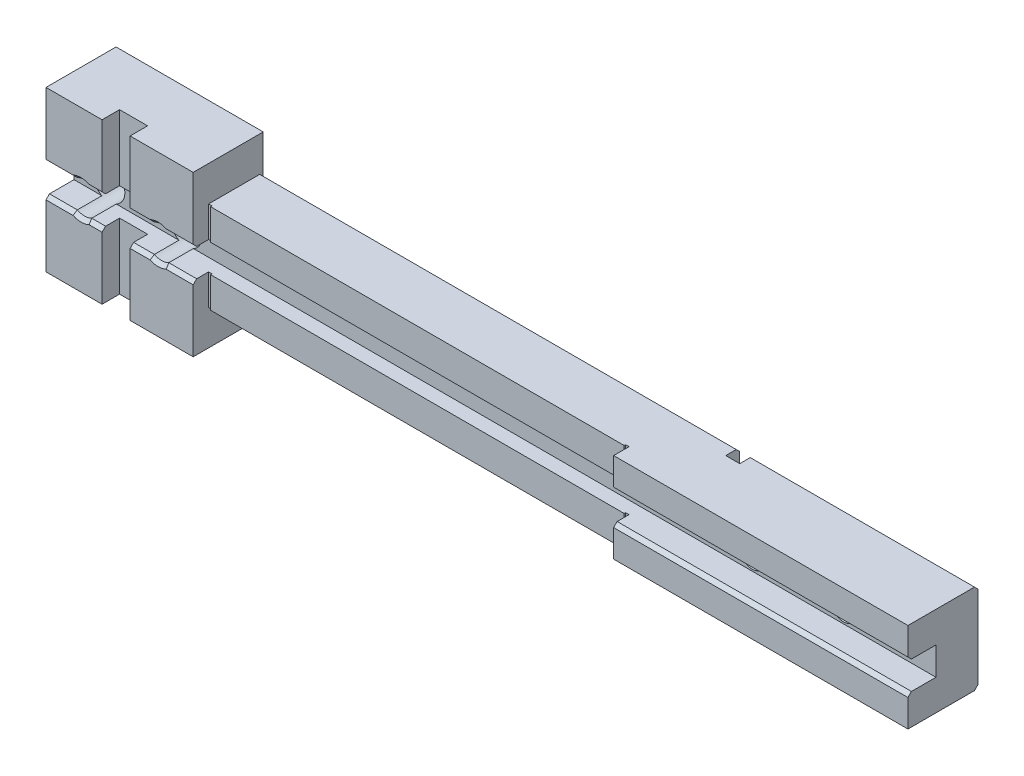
ISO-10303-21;
HEADER;
FILE_DESCRIPTION(('STEP AP214'),'2;1');
FILE_NAME('part.step','',(''),(''),'','','');
FILE_SCHEMA(('AUTOMOTIVE_DESIGN { 1 0 10303 214 1 1 1 1 }'));
ENDSEC;
DATA;
#1=APPLICATION_CONTEXT('core data for automotive mechanical design processes');
#2=APPLICATION_PROTOCOL_DEFINITION('international standard','automotive_design',2000,#1);
#3=PRODUCT_CONTEXT('',#1,'mechanical');
#4=PRODUCT('Part','Part','',(#3));
#5=PRODUCT_RELATED_PRODUCT_CATEGORY('part','',(#4));
#6=PRODUCT_DEFINITION_FORMATION('','',#4);
#7=PRODUCT_DEFINITION_CONTEXT('part definition',#1,'design');
#8=PRODUCT_DEFINITION('design','',#6,#7);
#9=PRODUCT_DEFINITION_SHAPE('','',#8);
#10=(LENGTH_UNIT() NAMED_UNIT(*) SI_UNIT(.MILLI.,.METRE.));
#11=(NAMED_UNIT(*) PLANE_ANGLE_UNIT() SI_UNIT($,.RADIAN.));
#12=(NAMED_UNIT(*) SI_UNIT($,.STERADIAN.) SOLID_ANGLE_UNIT());
#13=UNCERTAINTY_MEASURE_WITH_UNIT(LENGTH_MEASURE(1.E-05),#10,'distance_accuracy_value','');
#14=(GEOMETRIC_REPRESENTATION_CONTEXT(3) GLOBAL_UNCERTAINTY_ASSIGNED_CONTEXT((#13)) GLOBAL_UNIT_ASSIGNED_CONTEXT((#10,
#11,#12)) REPRESENTATION_CONTEXT('',''));
#15=CARTESIAN_POINT('',(0.,0.,0.));
#16=DIRECTION('',(0.,0.,1.));
#17=DIRECTION('',(1.,0.,0.));
#18=AXIS2_PLACEMENT_3D('',#15,#16,#17);
#19=CARTESIAN_POINT('',(0.,0.,31.4927569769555));
#20=DIRECTION('',(0.,0.,-1.));
#21=DIRECTION('',(-1.,0.,0.));
#22=AXIS2_PLACEMENT_3D('',#19,#20,#21);
#23=PLANE('',#22);
#24=DIRECTION('',(0.,1.,0.));
#25=VECTOR('',#24,1.);
#26=CARTESIAN_POINT('',(414.720096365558,10.46,31.4927569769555));
#27=LINE('',#26,#25);
#28=CARTESIAN_POINT('',(414.720096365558,19.36,31.4927569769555));
#29=VERTEX_POINT('',#28);
#30=CARTESIAN_POINT('',(414.720096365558,23.26,31.4927569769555));
#31=VERTEX_POINT('',#30);
#32=EDGE_CURVE('E403',#29,#31,#27,.T.);
#33=ORIENTED_EDGE('',*,*,#32,.F.);
#34=DIRECTION('',(1.,0.,0.));
#35=VECTOR('',#34,1.);
#36=CARTESIAN_POINT('',(0.,19.36,31.4927569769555));
#37=LINE('',#36,#35);
#38=CARTESIAN_POINT('',(456.720096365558,19.36,31.4927569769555));
#39=VERTEX_POINT('',#38);
#40=EDGE_CURVE('E782',#29,#39,#37,.T.);
#41=ORIENTED_EDGE('',*,*,#40,.T.);
#42=DIRECTION('',(0.,-1.,0.));
#43=VECTOR('',#42,1.);
#44=CARTESIAN_POINT('',(456.720096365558,23.26,31.4927569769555));
#45=LINE('',#44,#43);
#46=CARTESIAN_POINT('',(456.720096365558,23.26,31.4927569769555));
#47=VERTEX_POINT('',#46);
#48=EDGE_CURVE('E474',#47,#39,#45,.T.);
#49=ORIENTED_EDGE('',*,*,#48,.F.);
#50=DIRECTION('',(-1.,0.,0.));
#51=VECTOR('',#50,1.);
#52=CARTESIAN_POINT('',(421.720096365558,23.26,31.4927569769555));
#53=LINE('',#52,#51);
#54=EDGE_CURVE('E622',#47,#31,#53,.T.);
#55=ORIENTED_EDGE('',*,*,#54,.T.);
#56=EDGE_LOOP('',(#33,#41,#49,#55));
#57=FACE_BOUND('',#56,.T.);
#58=ADVANCED_FACE('F16',(#57),#23,.F.);
#59=CARTESIAN_POINT('',(414.720096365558,10.46,29.2927569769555));
#60=DIRECTION('',(-1.,0.,0.));
#61=DIRECTION('',(0.,0.,1.));
#62=AXIS2_PLACEMENT_3D('',#59,#60,#61);
#63=PLANE('',#62);
#64=DIRECTION('',(0.,-0.707106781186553,-0.707106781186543));
#65=VECTOR('',#64,1.);
#66=CARTESIAN_POINT('',(414.720096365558,13.81,25.9427569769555));
#67=LINE('',#66,#65);
#68=CARTESIAN_POINT('',(414.720096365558,18.86,30.9927569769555));
#69=VERTEX_POINT('',#68);
#70=EDGE_CURVE('E408',#29,#69,#67,.T.);
#71=ORIENTED_EDGE('',*,*,#70,.F.);
#72=ORIENTED_EDGE('',*,*,#32,.T.);
#73=DIRECTION('',(0.,0.,1.));
#74=VECTOR('',#73,1.);
#75=CARTESIAN_POINT('',(414.720096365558,23.26,29.2927569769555));
#76=LINE('',#75,#74);
#77=CARTESIAN_POINT('',(414.720096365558,23.26,29.2927569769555));
#78=VERTEX_POINT('',#77);
#79=EDGE_CURVE('E396',#78,#31,#76,.T.);
#80=ORIENTED_EDGE('',*,*,#79,.F.);
#81=DIRECTION('',(0.,1.,0.));
#82=VECTOR('',#81,1.);
#83=CARTESIAN_POINT('',(414.720096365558,5.46,29.2927569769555));
#84=LINE('',#83,#82);
#85=CARTESIAN_POINT('',(414.720096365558,18.86,29.2927569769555));
#86=VERTEX_POINT('',#85);
#87=EDGE_CURVE('E401',#86,#78,#84,.T.);
#88=ORIENTED_EDGE('',*,*,#87,.F.);
#89=DIRECTION('',(0.,0.,-1.));
#90=VECTOR('',#89,1.);
#91=CARTESIAN_POINT('',(414.720096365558,18.86,29.2927569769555));
#92=LINE('',#91,#90);
#93=EDGE_CURVE('E453',#69,#86,#92,.T.);
#94=ORIENTED_EDGE('',*,*,#93,.F.);
#95=EDGE_LOOP('',(#71,#72,#80,#88,#94));
#96=FACE_BOUND('',#95,.T.);
#97=ADVANCED_FACE('F399',(#96),#63,.T.);
#98=CARTESIAN_POINT('',(435.720096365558,14.86,27.4927569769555));
#99=DIRECTION('',(0.,-1.,0.));
#100=DIRECTION('',(0.,0.,-1.));
#101=AXIS2_PLACEMENT_3D('',#98,#99,#100);
#102=PLANE('',#101);
#103=DIRECTION('',(0.,0.,1.));
#104=VECTOR('',#103,1.);
#105=CARTESIAN_POINT('',(333.720096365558,14.86,27.4927569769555));
#106=LINE('',#105,#104);
#107=CARTESIAN_POINT('',(333.720096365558,14.86,27.4927569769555));
#108=VERTEX_POINT('',#107);
#109=CARTESIAN_POINT('',(333.720096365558,14.86,30.9927569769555));
#110=VERTEX_POINT('',#109);
#111=EDGE_CURVE('E678',#108,#110,#106,.T.);
#112=ORIENTED_EDGE('',*,*,#111,.T.);
#113=DIRECTION('',(1.,0.,0.));
#114=VECTOR('',#113,1.);
#115=CARTESIAN_POINT('',(435.720096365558,14.86,30.9927569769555));
#116=LINE('',#115,#114);
#117=CARTESIAN_POINT('',(337.689319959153,14.86,30.9927569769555));
#118=VERTEX_POINT('',#117);
#119=EDGE_CURVE('E818',#110,#118,#116,.T.);
#120=ORIENTED_EDGE('',*,*,#119,.T.);
#121=DIRECTION('',(0.,0.,-1.));
#122=VECTOR('',#121,1.);
#123=CARTESIAN_POINT('',(337.689319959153,14.86,21.4927569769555));
#124=LINE('',#123,#122);
#125=CARTESIAN_POINT('',(337.689319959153,14.86,27.4927569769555));
#126=VERTEX_POINT('',#125);
#127=EDGE_CURVE('E518',#118,#126,#124,.T.);
#128=ORIENTED_EDGE('',*,*,#127,.T.);
#129=DIRECTION('',(-1.,0.,0.));
#130=VECTOR('',#129,1.);
#131=CARTESIAN_POINT('',(435.720096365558,14.86,27.4927569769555));
#132=LINE('',#131,#130);
#133=EDGE_CURVE('E692',#126,#108,#132,.T.);
#134=ORIENTED_EDGE('',*,*,#133,.T.);
#135=EDGE_LOOP('',(#112,#120,#128,#134));
#136=FACE_BOUND('',#135,.T.);
#137=ADVANCED_FACE('F982',(#136),#102,.F.);
#138=CARTESIAN_POINT('',(435.720096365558,18.86,27.4927569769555));
#139=DIRECTION('',(0.,0.,-1.));
#140=DIRECTION('',(-1.,0.,0.));
#141=AXIS2_PLACEMENT_3D('',#138,#139,#140);
#142=PLANE('',#141);
#143=DIRECTION('',(-1.,0.,0.));
#144=VECTOR('',#143,1.);
#145=CARTESIAN_POINT('',(435.720096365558,18.86,27.4927569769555));
#146=LINE('',#145,#144);
#147=CARTESIAN_POINT('',(348.689319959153,18.86,27.4927569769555));
#148=VERTEX_POINT('',#147);
#149=CARTESIAN_POINT('',(339.750872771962,18.86,27.4927569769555));
#150=VERTEX_POINT('',#149);
#151=EDGE_CURVE('E696',#148,#150,#146,.T.);
#152=ORIENTED_EDGE('',*,*,#151,.T.);
#153=CARTESIAN_POINT('',(338.720096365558,16.86,27.4927569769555));
#154=DIRECTION('',(0.,0.,-1.));
#155=DIRECTION('',(-1.,0.,0.));
#156=AXIS2_PLACEMENT_3D('',#153,#154,#155);
#157=CIRCLE('',#156,2.24999999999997);
#158=CARTESIAN_POINT('',(339.750872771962,14.86,27.4927569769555));
#159=VERTEX_POINT('',#158);
#160=EDGE_CURVE('E519',#150,#159,#157,.T.);
#161=ORIENTED_EDGE('',*,*,#160,.T.);
#162=CARTESIAN_POINT('',(348.689319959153,14.86,27.4927569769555));
#163=VERTEX_POINT('',#162);
#164=EDGE_CURVE('E691',#163,#159,#132,.T.);
#165=ORIENTED_EDGE('',*,*,#164,.F.);
#166=CARTESIAN_POINT('',(349.720096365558,16.86,27.4927569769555));
#167=DIRECTION('',(0.,0.,-1.));
#168=DIRECTION('',(-1.,0.,0.));
#169=AXIS2_PLACEMENT_3D('',#166,#167,#168);
#170=CIRCLE('',#169,2.24999999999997);
#171=EDGE_CURVE('E529',#163,#148,#170,.T.);
#172=ORIENTED_EDGE('',*,*,#171,.T.);
#173=EDGE_LOOP('',(#152,#161,#165,#172));
#174=FACE_BOUND('',#173,.T.);
#175=ADVANCED_FACE('F1483',(#174),#142,.F.);
#176=CARTESIAN_POINT('',(435.720096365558,18.86,29.2927569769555));
#177=DIRECTION('',(0.,1.,0.));
#178=DIRECTION('',(0.,0.,1.));
#179=AXIS2_PLACEMENT_3D('',#176,#177,#178);
#180=PLANE('',#179);
#181=DIRECTION('',(0.,0.,-1.));
#182=VECTOR('',#181,1.);
#183=CARTESIAN_POINT('',(348.689319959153,18.86,21.4927569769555));
#184=LINE('',#183,#182);
#185=CARTESIAN_POINT('',(348.689319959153,18.86,30.9927569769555));
#186=VERTEX_POINT('',#185);
#187=EDGE_CURVE('E735',#148,#186,#184,.F.);
#188=ORIENTED_EDGE('',*,*,#187,.T.);
#189=DIRECTION('',(-1.,0.,0.));
#190=VECTOR('',#189,1.);
#191=CARTESIAN_POINT('',(435.720096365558,18.86,30.9927569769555));
#192=LINE('',#191,#190);
#193=CARTESIAN_POINT('',(345.720096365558,18.86,30.9927569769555));
#194=VERTEX_POINT('',#193);
#195=EDGE_CURVE('E759',#186,#194,#192,.T.);
#196=ORIENTED_EDGE('',*,*,#195,.T.);
#197=DIRECTION('',(0.,0.,-1.));
#198=VECTOR('',#197,1.);
#199=CARTESIAN_POINT('',(345.720096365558,18.86,29.2927569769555));
#200=LINE('',#199,#198);
#201=CARTESIAN_POINT('',(345.720096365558,18.86,28.9927569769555));
#202=VERTEX_POINT('',#201);
#203=EDGE_CURVE('E557',#194,#202,#200,.T.);
#204=ORIENTED_EDGE('',*,*,#203,.T.);
#205=DIRECTION('',(-1.,0.,0.));
#206=VECTOR('',#205,1.);
#207=CARTESIAN_POINT('',(435.720096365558,18.86,28.9927569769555));
#208=LINE('',#207,#206);
#209=CARTESIAN_POINT('',(341.720096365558,18.86,28.9927569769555));
#210=VERTEX_POINT('',#209);
#211=EDGE_CURVE('E549',#202,#210,#208,.T.);
#212=ORIENTED_EDGE('',*,*,#211,.T.);
#213=DIRECTION('',(0.,0.,1.));
#214=VECTOR('',#213,1.);
#215=CARTESIAN_POINT('',(341.720096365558,18.86,29.2927569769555));
#216=LINE('',#215,#214);
#217=CARTESIAN_POINT('',(341.720096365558,18.86,30.9927569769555));
#218=VERTEX_POINT('',#217);
#219=EDGE_CURVE('E559',#210,#218,#216,.T.);
#220=ORIENTED_EDGE('',*,*,#219,.T.);
#221=DIRECTION('',(-1.,0.,0.));
#222=VECTOR('',#221,1.);
#223=CARTESIAN_POINT('',(435.720096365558,18.86,30.9927569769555));
#224=LINE('',#223,#222);
#225=CARTESIAN_POINT('',(339.750872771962,18.86,30.9927569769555));
#226=VERTEX_POINT('',#225);
#227=EDGE_CURVE('E757',#218,#226,#224,.T.);
#228=ORIENTED_EDGE('',*,*,#227,.T.);
#229=DIRECTION('',(0.,0.,-1.));
#230=VECTOR('',#229,1.);
#231=CARTESIAN_POINT('',(339.750872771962,18.86,21.4927569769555));
#232=LINE('',#231,#230);
#233=EDGE_CURVE('E521',#226,#150,#232,.T.);
#234=ORIENTED_EDGE('',*,*,#233,.T.);
#235=ORIENTED_EDGE('',*,*,#151,.F.);
#236=EDGE_LOOP('',(#188,#196,#204,#212,#220,#228,#234,#235));
#237=FACE_BOUND('',#236,.T.);
#238=ADVANCED_FACE('F1479',(#237),#180,.F.);
#239=CARTESIAN_POINT('',(430.520096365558,16.7600000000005,27.4927569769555));
#240=DIRECTION('',(0.,0.,-1.));
#241=DIRECTION('',(-1.,0.,0.));
#242=AXIS2_PLACEMENT_3D('',#239,#240,#241);
#243=CIRCLE('',#242,1.65);
#244=CARTESIAN_POINT('',(428.870096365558,16.7600000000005,27.4927569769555));
#245=VERTEX_POINT('',#244);
#246=EDGE_CURVE('E465',#245,#245,#243,.T.);
#247=ORIENTED_EDGE('',*,*,#246,.T.);
#248=EDGE_LOOP('',(#247));
#249=FACE_BOUND('',#248,.T.);
#250=CARTESIAN_POINT('',(443.520096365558,16.7600000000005,27.4927569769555));
#251=DIRECTION('',(0.,0.,-1.));
#252=DIRECTION('',(-1.,0.,0.));
#253=AXIS2_PLACEMENT_3D('',#250,#251,#252);
#254=CIRCLE('',#253,1.65);
#255=CARTESIAN_POINT('',(441.870096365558,16.7600000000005,27.4927569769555));
#256=VERTEX_POINT('',#255);
#257=EDGE_CURVE('E20',#256,#256,#254,.T.);
#258=ORIENTED_EDGE('',*,*,#257,.T.);
#259=EDGE_LOOP('',(#258));
#260=FACE_BOUND('',#259,.T.);
#261=CARTESIAN_POINT('',(456.720096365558,18.86,27.4927569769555));
#262=VERTEX_POINT('',#261);
#263=CARTESIAN_POINT('',(350.750872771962,18.86,27.4927569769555));
#264=VERTEX_POINT('',#263);
#265=EDGE_CURVE('E693',#262,#264,#146,.T.);
#266=ORIENTED_EDGE('',*,*,#265,.T.);
#267=CARTESIAN_POINT('',(350.750872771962,14.86,27.4927569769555));
#268=VERTEX_POINT('',#267);
#269=EDGE_CURVE('E533',#264,#268,#170,.T.);
#270=ORIENTED_EDGE('',*,*,#269,.T.);
#271=CARTESIAN_POINT('',(456.720096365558,14.86,27.4927569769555));
#272=VERTEX_POINT('',#271);
#273=EDGE_CURVE('E687',#272,#268,#132,.T.);
#274=ORIENTED_EDGE('',*,*,#273,.F.);
#275=DIRECTION('',(0.,-1.,0.));
#276=VECTOR('',#275,1.);
#277=CARTESIAN_POINT('',(456.720096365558,18.86,27.4927569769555));
#278=LINE('',#277,#276);
#279=EDGE_CURVE('E483',#262,#272,#278,.T.);
#280=ORIENTED_EDGE('',*,*,#279,.F.);
#281=EDGE_LOOP('',(#266,#270,#274,#280));
#282=FACE_BOUND('',#281,.T.);
#283=ADVANCED_FACE('F1076',(#249,#260,#282),#142,.F.);
#284=DIRECTION('',(0.,0.,-1.));
#285=VECTOR('',#284,1.);
#286=CARTESIAN_POINT('',(339.750872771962,14.86,21.4927569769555));
#287=LINE('',#286,#285);
#288=CARTESIAN_POINT('',(339.750872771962,14.86,30.9927569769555));
#289=VERTEX_POINT('',#288);
#290=EDGE_CURVE('E523',#159,#289,#287,.F.);
#291=ORIENTED_EDGE('',*,*,#290,.T.);
#292=DIRECTION('',(1.,0.,0.));
#293=VECTOR('',#292,1.);
#294=CARTESIAN_POINT('',(435.720096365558,14.86,30.9927569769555));
#295=LINE('',#294,#293);
#296=CARTESIAN_POINT('',(341.720096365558,14.86,30.9927569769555));
#297=VERTEX_POINT('',#296);
#298=EDGE_CURVE('E822',#289,#297,#295,.T.);
#299=ORIENTED_EDGE('',*,*,#298,.T.);
#300=DIRECTION('',(0.,0.,1.));
#301=VECTOR('',#300,1.);
#302=CARTESIAN_POINT('',(341.720096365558,14.86,31.4927569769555));
#303=LINE('',#302,#301);
#304=CARTESIAN_POINT('',(341.720096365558,14.86,28.9927569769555));
#305=VERTEX_POINT('',#304);
#306=EDGE_CURVE('E562',#305,#297,#303,.T.);
#307=ORIENTED_EDGE('',*,*,#306,.F.);
#308=DIRECTION('',(-1.,0.,0.));
#309=VECTOR('',#308,1.);
#310=CARTESIAN_POINT('',(341.720096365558,14.86,28.9927569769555));
#311=LINE('',#310,#309);
#312=CARTESIAN_POINT('',(345.720096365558,14.86,28.9927569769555));
#313=VERTEX_POINT('',#312);
#314=EDGE_CURVE('E565',#313,#305,#311,.T.);
#315=ORIENTED_EDGE('',*,*,#314,.F.);
#316=DIRECTION('',(0.,0.,-1.));
#317=VECTOR('',#316,1.);
#318=CARTESIAN_POINT('',(345.720096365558,14.86,28.9927569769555));
#319=LINE('',#318,#317);
#320=CARTESIAN_POINT('',(345.720096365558,14.86,30.9927569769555));
#321=VERTEX_POINT('',#320);
#322=EDGE_CURVE('E568',#321,#313,#319,.T.);
#323=ORIENTED_EDGE('',*,*,#322,.F.);
#324=DIRECTION('',(1.,0.,0.));
#325=VECTOR('',#324,1.);
#326=CARTESIAN_POINT('',(435.720096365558,14.86,30.9927569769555));
#327=LINE('',#326,#325);
#328=CARTESIAN_POINT('',(348.689319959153,14.86,30.9927569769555));
#329=VERTEX_POINT('',#328);
#330=EDGE_CURVE('E820',#321,#329,#327,.T.);
#331=ORIENTED_EDGE('',*,*,#330,.T.);
#332=DIRECTION('',(0.,0.,-1.));
#333=VECTOR('',#332,1.);
#334=CARTESIAN_POINT('',(348.689319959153,14.86,21.4927569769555));
#335=LINE('',#334,#333);
#336=EDGE_CURVE('E532',#329,#163,#335,.T.);
#337=ORIENTED_EDGE('',*,*,#336,.T.);
#338=ORIENTED_EDGE('',*,*,#164,.T.);
#339=EDGE_LOOP('',(#291,#299,#307,#315,#323,#331,#337,#338));
#340=FACE_BOUND('',#339,.T.);
#341=ADVANCED_FACE('F1478',(#340),#102,.F.);
#342=ORIENTED_EDGE('',*,*,#93,.T.);
#343=DIRECTION('',(-1.,0.,0.));
#344=VECTOR('',#343,1.);
#345=CARTESIAN_POINT('',(435.720096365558,18.86,29.2927569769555));
#346=LINE('',#345,#344);
#347=CARTESIAN_POINT('',(414.220096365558,18.86,29.2927569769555));
#348=VERTEX_POINT('',#347);
#349=EDGE_CURVE('E417',#86,#348,#346,.T.);
#350=ORIENTED_EDGE('',*,*,#349,.T.);
#351=DIRECTION('',(0.,0.,1.));
#352=VECTOR('',#351,1.);
#353=CARTESIAN_POINT('',(414.220096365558,18.86,29.2927569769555));
#354=LINE('',#353,#352);
#355=CARTESIAN_POINT('',(414.220096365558,18.86,29.4927569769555));
#356=VERTEX_POINT('',#355);
#357=EDGE_CURVE('E437',#348,#356,#354,.T.);
#358=ORIENTED_EDGE('',*,*,#357,.T.);
#359=DIRECTION('',(1.,0.,0.));
#360=VECTOR('',#359,1.);
#361=CARTESIAN_POINT('',(421.220096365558,18.86,29.4927569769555));
#362=LINE('',#361,#360);
#363=CARTESIAN_POINT('',(355.220096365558,18.86,29.4927569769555));
#364=VERTEX_POINT('',#363);
#365=EDGE_CURVE('E611',#364,#356,#362,.T.);
#366=ORIENTED_EDGE('',*,*,#365,.F.);
#367=DIRECTION('',(0.,0.,-1.));
#368=VECTOR('',#367,1.);
#369=CARTESIAN_POINT('',(355.220096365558,18.86,29.4927569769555));
#370=LINE('',#369,#368);
#371=CARTESIAN_POINT('',(355.220096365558,18.86,29.2927569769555));
#372=VERTEX_POINT('',#371);
#373=EDGE_CURVE('E614',#364,#372,#370,.T.);
#374=ORIENTED_EDGE('',*,*,#373,.T.);
#375=DIRECTION('',(-1.,0.,0.));
#376=VECTOR('',#375,1.);
#377=CARTESIAN_POINT('',(435.720096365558,18.86,29.2927569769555));
#378=LINE('',#377,#376);
#379=CARTESIAN_POINT('',(354.720096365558,18.86,29.2927569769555));
#380=VERTEX_POINT('',#379);
#381=EDGE_CURVE('E698',#372,#380,#378,.T.);
#382=ORIENTED_EDGE('',*,*,#381,.T.);
#383=DIRECTION('',(0.,0.,-1.));
#384=VECTOR('',#383,1.);
#385=CARTESIAN_POINT('',(354.720096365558,18.86,31.4927569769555));
#386=LINE('',#385,#384);
#387=CARTESIAN_POINT('',(354.720096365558,18.86,30.9927569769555));
#388=VERTEX_POINT('',#387);
#389=EDGE_CURVE('E650',#388,#380,#386,.T.);
#390=ORIENTED_EDGE('',*,*,#389,.F.);
#391=DIRECTION('',(-1.,0.,0.));
#392=VECTOR('',#391,1.);
#393=CARTESIAN_POINT('',(435.720096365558,18.86,30.9927569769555));
#394=LINE('',#393,#392);
#395=CARTESIAN_POINT('',(350.750872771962,18.86,30.9927569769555));
#396=VERTEX_POINT('',#395);
#397=EDGE_CURVE('E751',#388,#396,#394,.T.);
#398=ORIENTED_EDGE('',*,*,#397,.T.);
#399=DIRECTION('',(0.,0.,-1.));
#400=VECTOR('',#399,1.);
#401=CARTESIAN_POINT('',(350.750872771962,18.86,21.4927569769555));
#402=LINE('',#401,#400);
#403=EDGE_CURVE('E738',#396,#264,#402,.T.);
#404=ORIENTED_EDGE('',*,*,#403,.T.);
#405=ORIENTED_EDGE('',*,*,#265,.F.);
#406=DIRECTION('',(0.,0.,-1.));
#407=VECTOR('',#406,1.);
#408=CARTESIAN_POINT('',(456.720096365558,18.86,30.9927569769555));
#409=LINE('',#408,#407);
#410=CARTESIAN_POINT('',(456.720096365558,18.86,30.9927569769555));
#411=VERTEX_POINT('',#410);
#412=EDGE_CURVE('E480',#411,#262,#409,.T.);
#413=ORIENTED_EDGE('',*,*,#412,.F.);
#414=DIRECTION('',(-1.,0.,0.));
#415=VECTOR('',#414,1.);
#416=CARTESIAN_POINT('',(435.720096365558,18.86,30.9927569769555));
#417=LINE('',#416,#415);
#418=EDGE_CURVE('E749',#411,#69,#417,.T.);
#419=ORIENTED_EDGE('',*,*,#418,.T.);
#420=EDGE_LOOP('',(#342,#350,#358,#366,#374,#382,#390,#398,#404,#405,#413,#419));
#421=FACE_BOUND('',#420,.T.);
#422=ADVANCED_FACE('F1072',(#421),#180,.F.);
#423=CARTESIAN_POINT('',(0.,0.,31.4927569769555));
#424=DIRECTION('',(0.,0.,-1.));
#425=DIRECTION('',(-1.,0.,0.));
#426=AXIS2_PLACEMENT_3D('',#423,#424,#425);
#427=PLANE('',#426);
#428=CARTESIAN_POINT('',(338.720096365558,16.86,31.4927569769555));
#429=DIRECTION('',(0.,0.,-1.));
#430=DIRECTION('',(-1.,0.,0.));
#431=AXIS2_PLACEMENT_3D('',#428,#429,#430);
#432=CIRCLE('',#431,2.75);
#433=CARTESIAN_POINT('',(337.574452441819,19.36,31.4927569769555));
#434=VERTEX_POINT('',#433);
#435=CARTESIAN_POINT('',(339.865740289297,19.36,31.4927569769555));
#436=VERTEX_POINT('',#435);
#437=EDGE_CURVE('E765',#434,#436,#432,.T.);
#438=ORIENTED_EDGE('',*,*,#437,.T.);
#439=DIRECTION('',(1.,0.,0.));
#440=VECTOR('',#439,1.);
#441=CARTESIAN_POINT('',(0.,19.36,31.4927569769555));
#442=LINE('',#441,#440);
#443=CARTESIAN_POINT('',(341.720096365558,19.36,31.4927569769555));
#444=VERTEX_POINT('',#443);
#445=EDGE_CURVE('E767',#436,#444,#442,.T.);
#446=ORIENTED_EDGE('',*,*,#445,.T.);
#447=DIRECTION('',(0.,1.,0.));
#448=VECTOR('',#447,1.);
#449=CARTESIAN_POINT('',(341.720096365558,5.46,31.4927569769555));
#450=LINE('',#449,#448);
#451=CARTESIAN_POINT('',(341.720096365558,28.26,31.4927569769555));
#452=VERTEX_POINT('',#451);
#453=EDGE_CURVE('E546',#444,#452,#450,.T.);
#454=ORIENTED_EDGE('',*,*,#453,.T.);
#455=DIRECTION('',(-1.,0.,0.));
#456=VECTOR('',#455,1.);
#457=CARTESIAN_POINT('',(333.720096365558,28.26,31.4927569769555));
#458=LINE('',#457,#456);
#459=CARTESIAN_POINT('',(333.720096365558,28.26,31.4927569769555));
#460=VERTEX_POINT('',#459);
#461=EDGE_CURVE('E646',#452,#460,#458,.T.);
#462=ORIENTED_EDGE('',*,*,#461,.T.);
#463=DIRECTION('',(0.,-1.,0.));
#464=VECTOR('',#463,1.);
#465=CARTESIAN_POINT('',(333.720096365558,18.86,31.4927569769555));
#466=LINE('',#465,#464);
#467=CARTESIAN_POINT('',(333.720096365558,19.36,31.4927569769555));
#468=VERTEX_POINT('',#467);
#469=EDGE_CURVE('E641',#460,#468,#466,.T.);
#470=ORIENTED_EDGE('',*,*,#469,.T.);
#471=DIRECTION('',(1.,0.,0.));
#472=VECTOR('',#471,1.);
#473=CARTESIAN_POINT('',(0.,19.36,31.4927569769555));
#474=LINE('',#473,#472);
#475=EDGE_CURVE('E763',#468,#434,#474,.T.);
#476=ORIENTED_EDGE('',*,*,#475,.T.);
#477=EDGE_LOOP('',(#438,#446,#454,#462,#470,#476));
#478=FACE_BOUND('',#477,.T.);
#479=ADVANCED_FACE('F1456',(#478),#427,.F.);
#480=CARTESIAN_POINT('',(0.,0.,31.4927569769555));
#481=DIRECTION('',(0.,0.,-1.));
#482=DIRECTION('',(-1.,0.,0.));
#483=AXIS2_PLACEMENT_3D('',#480,#481,#482);
#484=PLANE('',#483);
#485=CARTESIAN_POINT('',(349.720096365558,16.86,31.4927569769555));
#486=DIRECTION('',(0.,0.,-1.));
#487=DIRECTION('',(-1.,0.,0.));
#488=AXIS2_PLACEMENT_3D('',#485,#486,#487);
#489=CIRCLE('',#488,2.75);
#490=CARTESIAN_POINT('',(350.865740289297,14.36,31.4927569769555));
#491=VERTEX_POINT('',#490);
#492=CARTESIAN_POINT('',(348.574452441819,14.36,31.4927569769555));
#493=VERTEX_POINT('',#492);
#494=EDGE_CURVE('E828',#491,#493,#489,.T.);
#495=ORIENTED_EDGE('',*,*,#494,.T.);
#496=DIRECTION('',(-1.,0.,0.));
#497=VECTOR('',#496,1.);
#498=CARTESIAN_POINT('',(0.,14.36,31.4927569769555));
#499=LINE('',#498,#497);
#500=CARTESIAN_POINT('',(345.720096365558,14.36,31.4927569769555));
#501=VERTEX_POINT('',#500);
#502=EDGE_CURVE('E830',#493,#501,#499,.T.);
#503=ORIENTED_EDGE('',*,*,#502,.T.);
#504=DIRECTION('',(0.,-1.,0.));
#505=VECTOR('',#504,1.);
#506=CARTESIAN_POINT('',(345.720096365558,28.261,31.4927569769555));
#507=LINE('',#506,#505);
#508=CARTESIAN_POINT('',(345.720096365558,5.46,31.4927569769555));
#509=VERTEX_POINT('',#508);
#510=EDGE_CURVE('E579',#501,#509,#507,.T.);
#511=ORIENTED_EDGE('',*,*,#510,.T.);
#512=DIRECTION('',(1.,0.,0.));
#513=VECTOR('',#512,1.);
#514=CARTESIAN_POINT('',(354.720096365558,5.46,31.4927569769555));
#515=LINE('',#514,#513);
#516=CARTESIAN_POINT('',(354.720096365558,5.46,31.4927569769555));
#517=VERTEX_POINT('',#516);
#518=EDGE_CURVE('E670',#509,#517,#515,.T.);
#519=ORIENTED_EDGE('',*,*,#518,.T.);
#520=DIRECTION('',(0.,1.,0.));
#521=VECTOR('',#520,1.);
#522=CARTESIAN_POINT('',(354.720096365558,14.86,31.4927569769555));
#523=LINE('',#522,#521);
#524=CARTESIAN_POINT('',(354.720096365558,14.36,31.4927569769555));
#525=VERTEX_POINT('',#524);
#526=EDGE_CURVE('E665',#517,#525,#523,.T.);
#527=ORIENTED_EDGE('',*,*,#526,.T.);
#528=DIRECTION('',(-1.,0.,0.));
#529=VECTOR('',#528,1.);
#530=CARTESIAN_POINT('',(0.,14.36,31.4927569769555));
#531=LINE('',#530,#529);
#532=EDGE_CURVE('E826',#525,#491,#531,.T.);
#533=ORIENTED_EDGE('',*,*,#532,.T.);
#534=EDGE_LOOP('',(#495,#503,#511,#519,#527,#533));
#535=FACE_BOUND('',#534,.T.);
#536=ADVANCED_FACE('F1088',(#535),#484,.F.);
#537=CARTESIAN_POINT('',(0.,0.,21.4927569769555));
#538=DIRECTION('',(0.,0.,1.));
#539=DIRECTION('',(1.,0.,0.));
#540=AXIS2_PLACEMENT_3D('',#537,#538,#539);
#541=PLANE('',#540);
#542=CARTESIAN_POINT('',(338.720096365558,16.86,21.4927569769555));
#543=DIRECTION('',(0.,0.,-1.));
#544=DIRECTION('',(-1.,0.,0.));
#545=AXIS2_PLACEMENT_3D('',#542,#543,#544);
#546=CIRCLE('',#545,2.24999999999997);
#547=CARTESIAN_POINT('',(336.470096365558,16.86,21.4927569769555));
#548=VERTEX_POINT('',#547);
#549=EDGE_CURVE('E508',#548,#548,#546,.T.);
#550=ORIENTED_EDGE('',*,*,#549,.F.);
#551=EDGE_LOOP('',(#550));
#552=FACE_BOUND('',#551,.T.);
#553=CARTESIAN_POINT('',(349.720096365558,16.86,21.4927569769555));
#554=DIRECTION('',(0.,0.,-1.));
#555=DIRECTION('',(-1.,0.,0.));
#556=AXIS2_PLACEMENT_3D('',#553,#554,#555);
#557=CIRCLE('',#556,2.24999999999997);
#558=CARTESIAN_POINT('',(347.470096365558,16.86,21.4927569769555));
#559=VERTEX_POINT('',#558);
#560=EDGE_CURVE('E526',#559,#559,#557,.T.);
#561=ORIENTED_EDGE('',*,*,#560,.F.);
#562=EDGE_LOOP('',(#561));
#563=FACE_BOUND('',#562,.T.);
#564=DIRECTION('',(0.,-1.,0.));
#565=VECTOR('',#564,1.);
#566=CARTESIAN_POINT('',(422.720096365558,28.26,21.4927569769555));
#567=LINE('',#566,#565);
#568=CARTESIAN_POINT('',(422.720096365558,22.76,21.4927569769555));
#569=VERTEX_POINT('',#568);
#570=CARTESIAN_POINT('',(422.720096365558,10.96,21.4927569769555));
#571=VERTEX_POINT('',#570);
#572=EDGE_CURVE('E595',#569,#571,#567,.T.);
#573=ORIENTED_EDGE('',*,*,#572,.T.);
#574=DIRECTION('',(-1.,0.,0.));
#575=VECTOR('',#574,1.);
#576=CARTESIAN_POINT('',(0.,10.96,21.4927569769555));
#577=LINE('',#576,#575);
#578=CARTESIAN_POINT('',(354.720096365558,10.96,21.4927569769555));
#579=VERTEX_POINT('',#578);
#580=EDGE_CURVE('E787',#571,#579,#577,.T.);
#581=ORIENTED_EDGE('',*,*,#580,.T.);
#582=DIRECTION('',(0.,-1.,0.));
#583=VECTOR('',#582,1.);
#584=CARTESIAN_POINT('',(354.720096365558,10.46,21.4927569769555));
#585=LINE('',#584,#583);
#586=CARTESIAN_POINT('',(354.720096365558,5.46,21.4927569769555));
#587=VERTEX_POINT('',#586);
#588=EDGE_CURVE('E703',#579,#587,#585,.T.);
#589=ORIENTED_EDGE('',*,*,#588,.T.);
#590=DIRECTION('',(1.,0.,0.));
#591=VECTOR('',#590,1.);
#592=CARTESIAN_POINT('',(333.720096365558,5.46,21.4927569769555));
#593=LINE('',#592,#591);
#594=CARTESIAN_POINT('',(333.720096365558,5.46,21.4927569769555));
#595=VERTEX_POINT('',#594);
#596=EDGE_CURVE('E716',#595,#587,#593,.T.);
#597=ORIENTED_EDGE('',*,*,#596,.F.);
#598=DIRECTION('',(0.,-1.,0.));
#599=VECTOR('',#598,1.);
#600=CARTESIAN_POINT('',(333.720096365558,28.26,21.4927569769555));
#601=LINE('',#600,#599);
#602=CARTESIAN_POINT('',(333.720096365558,28.26,21.4927569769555));
#603=VERTEX_POINT('',#602);
#604=EDGE_CURVE('E712',#603,#595,#601,.T.);
#605=ORIENTED_EDGE('',*,*,#604,.F.);
#606=DIRECTION('',(-1.,0.,0.));
#607=VECTOR('',#606,1.);
#608=CARTESIAN_POINT('',(435.720096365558,28.26,21.4927569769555));
#609=LINE('',#608,#607);
#610=CARTESIAN_POINT('',(354.720096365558,28.26,21.4927569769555));
#611=VERTEX_POINT('',#610);
#612=EDGE_CURVE('E719',#611,#603,#609,.T.);
#613=ORIENTED_EDGE('',*,*,#612,.F.);
#614=DIRECTION('',(0.,-1.,0.));
#615=VECTOR('',#614,1.);
#616=CARTESIAN_POINT('',(354.720096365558,28.26,21.4927569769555));
#617=LINE('',#616,#615);
#618=CARTESIAN_POINT('',(354.720096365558,22.76,21.4927569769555));
#619=VERTEX_POINT('',#618);
#620=EDGE_CURVE('E655',#611,#619,#617,.T.);
#621=ORIENTED_EDGE('',*,*,#620,.T.);
#622=DIRECTION('',(1.,0.,0.));
#623=VECTOR('',#622,1.);
#624=CARTESIAN_POINT('',(0.,22.76,21.4927569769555));
#625=LINE('',#624,#623);
#626=EDGE_CURVE('E784',#619,#569,#625,.T.);
#627=ORIENTED_EDGE('',*,*,#626,.T.);
#628=EDGE_LOOP('',(#573,#581,#589,#597,#605,#613,#621,#627));
#629=FACE_BOUND('',#628,.T.);
#630=ADVANCED_FACE('F1042',(#552,#563,#629),#541,.F.);
#631=CARTESIAN_POINT('',(0.,0.,29.2927569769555));
#632=DIRECTION('',(0.,0.,1.));
#633=DIRECTION('',(1.,0.,0.));
#634=AXIS2_PLACEMENT_3D('',#631,#632,#633);
#635=PLANE('',#634);
#636=ORIENTED_EDGE('',*,*,#381,.F.);
#637=DIRECTION('',(0.,-1.,0.));
#638=VECTOR('',#637,1.);
#639=CARTESIAN_POINT('',(355.220096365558,18.86,29.2927569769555));
#640=LINE('',#639,#638);
#641=CARTESIAN_POINT('',(355.220096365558,23.26,29.2927569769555));
#642=VERTEX_POINT('',#641);
#643=EDGE_CURVE('E598',#642,#372,#640,.T.);
#644=ORIENTED_EDGE('',*,*,#643,.F.);
#645=DIRECTION('',(1.,0.,0.));
#646=VECTOR('',#645,1.);
#647=CARTESIAN_POINT('',(354.720096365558,23.26,29.2927569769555));
#648=LINE('',#647,#646);
#649=CARTESIAN_POINT('',(354.720096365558,23.26,29.2927569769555));
#650=VERTEX_POINT('',#649);
#651=EDGE_CURVE('E654',#650,#642,#648,.T.);
#652=ORIENTED_EDGE('',*,*,#651,.F.);
#653=DIRECTION('',(0.,1.,0.));
#654=VECTOR('',#653,1.);
#655=CARTESIAN_POINT('',(354.720096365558,28.26,29.2927569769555));
#656=LINE('',#655,#654);
#657=EDGE_CURVE('E640',#380,#650,#656,.T.);
#658=ORIENTED_EDGE('',*,*,#657,.F.);
#659=EDGE_LOOP('',(#636,#644,#652,#658));
#660=FACE_BOUND('',#659,.T.);
#661=ADVANCED_FACE('F1121',(#660),#635,.T.);
#662=DIRECTION('',(-1.,0.,0.));
#663=VECTOR('',#662,1.);
#664=CARTESIAN_POINT('',(435.720096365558,10.46,29.2927569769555));
#665=LINE('',#664,#663);
#666=CARTESIAN_POINT('',(355.220096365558,10.46,29.2927569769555));
#667=VERTEX_POINT('',#666);
#668=CARTESIAN_POINT('',(354.720096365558,10.46,29.2927569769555));
#669=VERTEX_POINT('',#668);
#670=EDGE_CURVE('E690',#667,#669,#665,.T.);
#671=ORIENTED_EDGE('',*,*,#670,.F.);
#672=DIRECTION('',(0.,-1.,0.));
#673=VECTOR('',#672,1.);
#674=CARTESIAN_POINT('',(355.220096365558,10.46,29.2927569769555));
#675=LINE('',#674,#673);
#676=CARTESIAN_POINT('',(355.220096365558,14.86,29.2927569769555));
#677=VERTEX_POINT('',#676);
#678=EDGE_CURVE('E624',#677,#667,#675,.T.);
#679=ORIENTED_EDGE('',*,*,#678,.F.);
#680=DIRECTION('',(-1.,0.,0.));
#681=VECTOR('',#680,1.);
#682=CARTESIAN_POINT('',(435.720096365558,14.86,29.2927569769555));
#683=LINE('',#682,#681);
#684=CARTESIAN_POINT('',(354.720096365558,14.86,29.2927569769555));
#685=VERTEX_POINT('',#684);
#686=EDGE_CURVE('E686',#677,#685,#683,.T.);
#687=ORIENTED_EDGE('',*,*,#686,.T.);
#688=DIRECTION('',(0.,1.,0.));
#689=VECTOR('',#688,1.);
#690=CARTESIAN_POINT('',(354.720096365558,14.86,29.2927569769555));
#691=LINE('',#690,#689);
#692=EDGE_CURVE('E662',#669,#685,#691,.T.);
#693=ORIENTED_EDGE('',*,*,#692,.F.);
#694=EDGE_LOOP('',(#671,#679,#687,#693));
#695=FACE_BOUND('',#694,.T.);
#696=ADVANCED_FACE('F1029',(#695),#635,.T.);
#697=CARTESIAN_POINT('',(333.720096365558,28.26,21.4927569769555));
#698=DIRECTION('',(-1.,0.,0.));
#699=DIRECTION('',(0.,0.,1.));
#700=AXIS2_PLACEMENT_3D('',#697,#698,#699);
#701=PLANE('',#700);
#702=DIRECTION('',(0.,0.,-1.));
#703=VECTOR('',#702,1.);
#704=CARTESIAN_POINT('',(333.720096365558,18.86,29.2927569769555));
#705=LINE('',#704,#703);
#706=CARTESIAN_POINT('',(333.720096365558,18.86,30.9927569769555));
#707=VERTEX_POINT('',#706);
#708=CARTESIAN_POINT('',(333.720096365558,18.86,27.4927569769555));
#709=VERTEX_POINT('',#708);
#710=EDGE_CURVE('E681',#707,#709,#705,.T.);
#711=ORIENTED_EDGE('',*,*,#710,.F.);
#712=DIRECTION('',(0.,-0.707106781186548,-0.707106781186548));
#713=VECTOR('',#712,1.);
#714=CARTESIAN_POINT('',(333.720096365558,18.81,30.9427569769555));
#715=LINE('',#714,#713);
#716=EDGE_CURVE('E780',#707,#468,#715,.F.);
#717=ORIENTED_EDGE('',*,*,#716,.T.);
#718=ORIENTED_EDGE('',*,*,#469,.F.);
#719=DIRECTION('',(0.,0.,1.));
#720=VECTOR('',#719,1.);
#721=CARTESIAN_POINT('',(333.720096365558,28.26,21.4927569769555));
#722=LINE('',#721,#720);
#723=EDGE_CURVE('E722',#603,#460,#722,.T.);
#724=ORIENTED_EDGE('',*,*,#723,.F.);
#725=ORIENTED_EDGE('',*,*,#604,.T.);
#726=DIRECTION('',(0.,0.,1.));
#727=VECTOR('',#726,1.);
#728=CARTESIAN_POINT('',(333.720096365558,5.46,21.4927569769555));
#729=LINE('',#728,#727);
#730=CARTESIAN_POINT('',(333.720096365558,5.46,31.4927569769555));
#731=VERTEX_POINT('',#730);
#732=EDGE_CURVE('E721',#595,#731,#729,.T.);
#733=ORIENTED_EDGE('',*,*,#732,.T.);
#734=DIRECTION('',(0.,-1.,0.));
#735=VECTOR('',#734,1.);
#736=CARTESIAN_POINT('',(333.720096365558,5.46,31.4927569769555));
#737=LINE('',#736,#735);
#738=CARTESIAN_POINT('',(333.720096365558,14.36,31.4927569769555));
#739=VERTEX_POINT('',#738);
#740=EDGE_CURVE('E668',#739,#731,#737,.T.);
#741=ORIENTED_EDGE('',*,*,#740,.F.);
#742=DIRECTION('',(0.,-0.707106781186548,0.707106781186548));
#743=VECTOR('',#742,1.);
#744=CARTESIAN_POINT('',(333.720096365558,26.31,19.5427569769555));
#745=LINE('',#744,#743);
#746=EDGE_CURVE('E778',#739,#110,#745,.F.);
#747=ORIENTED_EDGE('',*,*,#746,.T.);
#748=ORIENTED_EDGE('',*,*,#111,.F.);
#749=DIRECTION('',(0.,-1.,0.));
#750=VECTOR('',#749,1.);
#751=CARTESIAN_POINT('',(333.720096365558,18.86,27.4927569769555));
#752=LINE('',#751,#750);
#753=EDGE_CURVE('E683',#709,#108,#752,.T.);
#754=ORIENTED_EDGE('',*,*,#753,.F.);
#755=EDGE_LOOP('',(#711,#717,#718,#724,#725,#733,#741,#747,#748,#754));
#756=FACE_BOUND('',#755,.T.);
#757=ADVANCED_FACE('F1102',(#756),#701,.T.);
#758=CARTESIAN_POINT('',(435.720096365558,28.26,21.4927569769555));
#759=DIRECTION('',(0.,1.,0.));
#760=DIRECTION('',(0.,0.,1.));
#761=AXIS2_PLACEMENT_3D('',#758,#759,#760);
#762=PLANE('',#761);
#763=DIRECTION('',(0.,0.,1.));
#764=VECTOR('',#763,1.);
#765=CARTESIAN_POINT('',(341.720096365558,28.26,28.9927569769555));
#766=LINE('',#765,#764);
#767=CARTESIAN_POINT('',(341.720096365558,28.26,28.9927569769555));
#768=VERTEX_POINT('',#767);
#769=EDGE_CURVE('E537',#768,#452,#766,.T.);
#770=ORIENTED_EDGE('',*,*,#769,.F.);
#771=DIRECTION('',(-1.,0.,0.));
#772=VECTOR('',#771,1.);
#773=CARTESIAN_POINT('',(345.720096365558,28.26,28.9927569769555));
#774=LINE('',#773,#772);
#775=CARTESIAN_POINT('',(345.720096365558,28.26,28.9927569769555));
#776=VERTEX_POINT('',#775);
#777=EDGE_CURVE('E543',#776,#768,#774,.T.);
#778=ORIENTED_EDGE('',*,*,#777,.F.);
#779=DIRECTION('',(0.,0.,-1.));
#780=VECTOR('',#779,1.);
#781=CARTESIAN_POINT('',(345.720096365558,28.26,31.4927569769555));
#782=LINE('',#781,#780);
#783=CARTESIAN_POINT('',(345.720096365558,28.26,31.4927569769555));
#784=VERTEX_POINT('',#783);
#785=EDGE_CURVE('E540',#784,#776,#782,.T.);
#786=ORIENTED_EDGE('',*,*,#785,.F.);
#787=CARTESIAN_POINT('',(354.720096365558,28.26,31.4927569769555));
#788=VERTEX_POINT('',#787);
#789=EDGE_CURVE('E647',#788,#784,#458,.T.);
#790=ORIENTED_EDGE('',*,*,#789,.F.);
#791=DIRECTION('',(0.,0.,1.));
#792=VECTOR('',#791,1.);
#793=CARTESIAN_POINT('',(354.720096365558,28.26,21.4927569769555));
#794=LINE('',#793,#792);
#795=EDGE_CURVE('E657',#611,#788,#794,.T.);
#796=ORIENTED_EDGE('',*,*,#795,.F.);
#797=ORIENTED_EDGE('',*,*,#612,.T.);
#798=ORIENTED_EDGE('',*,*,#723,.T.);
#799=ORIENTED_EDGE('',*,*,#461,.F.);
#800=EDGE_LOOP('',(#770,#778,#786,#790,#796,#797,#798,#799));
#801=FACE_BOUND('',#800,.T.);
#802=ADVANCED_FACE('F1108',(#801),#762,.T.);
#803=CARTESIAN_POINT('',(333.720096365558,5.46,21.4927569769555));
#804=DIRECTION('',(0.,-1.,0.));
#805=DIRECTION('',(0.,0.,-1.));
#806=AXIS2_PLACEMENT_3D('',#803,#804,#805);
#807=PLANE('',#806);
#808=DIRECTION('',(0.,0.,1.));
#809=VECTOR('',#808,1.);
#810=CARTESIAN_POINT('',(345.720096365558,5.46,28.9927569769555));
#811=LINE('',#810,#809);
#812=CARTESIAN_POINT('',(345.720096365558,5.46,28.9927569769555));
#813=VERTEX_POINT('',#812);
#814=EDGE_CURVE('E570',#813,#509,#811,.T.);
#815=ORIENTED_EDGE('',*,*,#814,.F.);
#816=DIRECTION('',(1.,0.,0.));
#817=VECTOR('',#816,1.);
#818=CARTESIAN_POINT('',(341.720096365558,5.46,28.9927569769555));
#819=LINE('',#818,#817);
#820=CARTESIAN_POINT('',(341.720096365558,5.46,28.9927569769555));
#821=VERTEX_POINT('',#820);
#822=EDGE_CURVE('E576',#821,#813,#819,.T.);
#823=ORIENTED_EDGE('',*,*,#822,.F.);
#824=DIRECTION('',(0.,0.,-1.));
#825=VECTOR('',#824,1.);
#826=CARTESIAN_POINT('',(341.720096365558,5.46,31.4927569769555));
#827=LINE('',#826,#825);
#828=CARTESIAN_POINT('',(341.720096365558,5.46,31.4927569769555));
#829=VERTEX_POINT('',#828);
#830=EDGE_CURVE('E573',#829,#821,#827,.T.);
#831=ORIENTED_EDGE('',*,*,#830,.F.);
#832=EDGE_CURVE('E671',#731,#829,#515,.T.);
#833=ORIENTED_EDGE('',*,*,#832,.F.);
#834=ORIENTED_EDGE('',*,*,#732,.F.);
#835=ORIENTED_EDGE('',*,*,#596,.T.);
#836=DIRECTION('',(0.,0.,1.));
#837=VECTOR('',#836,1.);
#838=CARTESIAN_POINT('',(354.720096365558,5.46,21.4927569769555));
#839=LINE('',#838,#837);
#840=EDGE_CURVE('E709',#587,#517,#839,.T.);
#841=ORIENTED_EDGE('',*,*,#840,.T.);
#842=ORIENTED_EDGE('',*,*,#518,.F.);
#843=EDGE_LOOP('',(#815,#823,#831,#833,#834,#835,#841,#842));
#844=FACE_BOUND('',#843,.T.);
#845=ADVANCED_FACE('F1096',(#844),#807,.T.);
#846=CARTESIAN_POINT('',(430.520096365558,16.7600000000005,21.4927569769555));
#847=DIRECTION('',(0.,0.,-1.));
#848=DIRECTION('',(-1.,0.,0.));
#849=AXIS2_PLACEMENT_3D('',#846,#847,#848);
#850=CIRCLE('',#849,1.65);
#851=CARTESIAN_POINT('',(428.870096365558,16.7600000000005,21.4927569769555));
#852=VERTEX_POINT('',#851);
#853=EDGE_CURVE('E462',#852,#852,#850,.T.);
#854=ORIENTED_EDGE('',*,*,#853,.F.);
#855=EDGE_LOOP('',(#854));
#856=FACE_BOUND('',#855,.T.);
#857=CARTESIAN_POINT('',(443.520096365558,16.7600000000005,21.4927569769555));
#858=DIRECTION('',(0.,0.,-1.));
#859=DIRECTION('',(-1.,0.,0.));
#860=AXIS2_PLACEMENT_3D('',#857,#858,#859);
#861=CIRCLE('',#860,1.65);
#862=CARTESIAN_POINT('',(441.870096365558,16.7600000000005,21.4927569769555));
#863=VERTEX_POINT('',#862);
#864=EDGE_CURVE('E468',#863,#863,#861,.T.);
#865=ORIENTED_EDGE('',*,*,#864,.F.);
#866=EDGE_LOOP('',(#865));
#867=FACE_BOUND('',#866,.T.);
#868=DIRECTION('',(0.,-1.,0.));
#869=VECTOR('',#868,1.);
#870=CARTESIAN_POINT('',(424.720096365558,28.26,21.4927569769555));
#871=LINE('',#870,#869);
#872=CARTESIAN_POINT('',(424.720096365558,22.76,21.4927569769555));
#873=VERTEX_POINT('',#872);
#874=CARTESIAN_POINT('',(424.720096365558,10.96,21.4927569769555));
#875=VERTEX_POINT('',#874);
#876=EDGE_CURVE('E602',#873,#875,#871,.T.);
#877=ORIENTED_EDGE('',*,*,#876,.F.);
#878=DIRECTION('',(1.,0.,0.));
#879=VECTOR('',#878,1.);
#880=CARTESIAN_POINT('',(0.,22.76,21.4927569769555));
#881=LINE('',#880,#879);
#882=CARTESIAN_POINT('',(456.720096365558,22.76,21.4927569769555));
#883=VERTEX_POINT('',#882);
#884=EDGE_CURVE('E801',#873,#883,#881,.T.);
#885=ORIENTED_EDGE('',*,*,#884,.T.);
#886=DIRECTION('',(0.,1.,0.));
#887=VECTOR('',#886,1.);
#888=CARTESIAN_POINT('',(456.720096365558,10.96,21.4927569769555));
#889=LINE('',#888,#887);
#890=CARTESIAN_POINT('',(456.720096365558,10.96,21.4927569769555));
#891=VERTEX_POINT('',#890);
#892=EDGE_CURVE('E501',#891,#883,#889,.T.);
#893=ORIENTED_EDGE('',*,*,#892,.F.);
#894=DIRECTION('',(-1.,0.,0.));
#895=VECTOR('',#894,1.);
#896=CARTESIAN_POINT('',(0.,10.96,21.4927569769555));
#897=LINE('',#896,#895);
#898=EDGE_CURVE('E798',#891,#875,#897,.T.);
#899=ORIENTED_EDGE('',*,*,#898,.T.);
#900=EDGE_LOOP('',(#877,#885,#893,#899));
#901=FACE_BOUND('',#900,.T.);
#902=ADVANCED_FACE('F1064',(#856,#867,#901),#541,.F.);
#903=CARTESIAN_POINT('',(354.720096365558,10.46,21.4927569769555));
#904=DIRECTION('',(-1.,0.,0.));
#905=DIRECTION('',(0.,0.,1.));
#906=AXIS2_PLACEMENT_3D('',#903,#904,#905);
#907=PLANE('',#906);
#908=DIRECTION('',(0.,0.,-1.));
#909=VECTOR('',#908,1.);
#910=CARTESIAN_POINT('',(354.720096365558,14.86,31.4927569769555));
#911=LINE('',#910,#909);
#912=CARTESIAN_POINT('',(354.720096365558,14.86,30.9927569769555));
#913=VERTEX_POINT('',#912);
#914=EDGE_CURVE('E674',#913,#685,#911,.T.);
#915=ORIENTED_EDGE('',*,*,#914,.F.);
#916=DIRECTION('',(0.,0.707106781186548,-0.707106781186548));
#917=VECTOR('',#916,1.);
#918=CARTESIAN_POINT('',(354.720096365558,14.36,31.4927569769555));
#919=LINE('',#918,#917);
#920=EDGE_CURVE('E838',#913,#525,#919,.F.);
#921=ORIENTED_EDGE('',*,*,#920,.T.);
#922=ORIENTED_EDGE('',*,*,#526,.F.);
#923=ORIENTED_EDGE('',*,*,#840,.F.);
#924=ORIENTED_EDGE('',*,*,#588,.F.);
#925=DIRECTION('',(0.,0.707106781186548,-0.707106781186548));
#926=VECTOR('',#925,1.);
#927=CARTESIAN_POINT('',(354.720096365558,10.71,21.7427569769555));
#928=LINE('',#927,#926);
#929=CARTESIAN_POINT('',(354.720096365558,10.46,21.9927569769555));
#930=VERTEX_POINT('',#929);
#931=EDGE_CURVE('E25',#579,#930,#928,.F.);
#932=ORIENTED_EDGE('',*,*,#931,.T.);
#933=DIRECTION('',(0.,0.,1.));
#934=VECTOR('',#933,1.);
#935=CARTESIAN_POINT('',(354.720096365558,10.46,21.4927569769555));
#936=LINE('',#935,#934);
#937=EDGE_CURVE('E706',#930,#669,#936,.T.);
#938=ORIENTED_EDGE('',*,*,#937,.T.);
#939=ORIENTED_EDGE('',*,*,#692,.T.);
#940=EDGE_LOOP('',(#915,#921,#922,#923,#924,#932,#938,#939));
#941=FACE_BOUND('',#940,.T.);
#942=ADVANCED_FACE('F1031',(#941),#907,.F.);
#943=CARTESIAN_POINT('',(435.720096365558,10.46,21.4927569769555));
#944=DIRECTION('',(0.,1.,0.));
#945=DIRECTION('',(0.,0.,1.));
#946=AXIS2_PLACEMENT_3D('',#943,#944,#945);
#947=PLANE('',#946);
#948=DIRECTION('',(0.,0.,1.));
#949=VECTOR('',#948,1.);
#950=CARTESIAN_POINT('',(414.720096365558,10.46,29.2927569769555));
#951=LINE('',#950,#949);
#952=CARTESIAN_POINT('',(414.720096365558,10.46,29.2927569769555));
#953=VERTEX_POINT('',#952);
#954=CARTESIAN_POINT('',(414.720096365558,10.46,31.4927569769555));
#955=VERTEX_POINT('',#954);
#956=EDGE_CURVE('E407',#953,#955,#951,.T.);
#957=ORIENTED_EDGE('',*,*,#956,.F.);
#958=DIRECTION('',(-1.,0.,0.));
#959=VECTOR('',#958,1.);
#960=CARTESIAN_POINT('',(435.720096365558,10.46,29.2927569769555));
#961=LINE('',#960,#959);
#962=CARTESIAN_POINT('',(414.220096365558,10.46,29.2927569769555));
#963=VERTEX_POINT('',#962);
#964=EDGE_CURVE('E443',#953,#963,#961,.T.);
#965=ORIENTED_EDGE('',*,*,#964,.T.);
#966=DIRECTION('',(0.,0.,1.));
#967=VECTOR('',#966,1.);
#968=CARTESIAN_POINT('',(414.220096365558,10.46,21.4927569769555));
#969=LINE('',#968,#967);
#970=CARTESIAN_POINT('',(414.220096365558,10.46,29.4927569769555));
#971=VERTEX_POINT('',#970);
#972=EDGE_CURVE('E434',#963,#971,#969,.T.);
#973=ORIENTED_EDGE('',*,*,#972,.T.);
#974=DIRECTION('',(1.,0.,0.));
#975=VECTOR('',#974,1.);
#976=CARTESIAN_POINT('',(435.720096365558,10.46,29.4927569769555));
#977=LINE('',#976,#975);
#978=CARTESIAN_POINT('',(355.220096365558,10.46,29.4927569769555));
#979=VERTEX_POINT('',#978);
#980=EDGE_CURVE('E625',#979,#971,#977,.T.);
#981=ORIENTED_EDGE('',*,*,#980,.F.);
#982=DIRECTION('',(0.,0.,-1.));
#983=VECTOR('',#982,1.);
#984=CARTESIAN_POINT('',(355.220096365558,10.46,29.4927569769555));
#985=LINE('',#984,#983);
#986=EDGE_CURVE('E632',#979,#667,#985,.T.);
#987=ORIENTED_EDGE('',*,*,#986,.T.);
#988=ORIENTED_EDGE('',*,*,#670,.T.);
#989=ORIENTED_EDGE('',*,*,#937,.F.);
#990=DIRECTION('',(1.,0.,0.));
#991=VECTOR('',#990,1.);
#992=CARTESIAN_POINT('',(435.720096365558,10.46,21.9927569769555));
#993=LINE('',#992,#991);
#994=CARTESIAN_POINT('',(422.720096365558,10.46,21.9927569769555));
#995=VERTEX_POINT('',#994);
#996=EDGE_CURVE('E792',#930,#995,#993,.T.);
#997=ORIENTED_EDGE('',*,*,#996,.T.);
#998=DIRECTION('',(0.,0.,-1.));
#999=VECTOR('',#998,1.);
#1000=CARTESIAN_POINT('',(422.720096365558,10.46,23.4927569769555));
#1001=LINE('',#1000,#999);
#1002=CARTESIAN_POINT('',(422.720096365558,10.46,23.4927569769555));
#1003=VERTEX_POINT('',#1002);
#1004=EDGE_CURVE('E582',#1003,#995,#1001,.T.);
#1005=ORIENTED_EDGE('',*,*,#1004,.F.);
#1006=DIRECTION('',(-1.,0.,0.));
#1007=VECTOR('',#1006,1.);
#1008=CARTESIAN_POINT('',(424.720096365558,10.46,23.4927569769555));
#1009=LINE('',#1008,#1007);
#1010=CARTESIAN_POINT('',(424.720096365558,10.46,23.4927569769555));
#1011=VERTEX_POINT('',#1010);
#1012=EDGE_CURVE('E592',#1011,#1003,#1009,.T.);
#1013=ORIENTED_EDGE('',*,*,#1012,.F.);
#1014=DIRECTION('',(0.,0.,1.));
#1015=VECTOR('',#1014,1.);
#1016=CARTESIAN_POINT('',(424.720096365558,10.46,21.4927569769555));
#1017=LINE('',#1016,#1015);
#1018=CARTESIAN_POINT('',(424.720096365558,10.46,21.9927569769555));
#1019=VERTEX_POINT('',#1018);
#1020=EDGE_CURVE('E590',#1019,#1011,#1017,.T.);
#1021=ORIENTED_EDGE('',*,*,#1020,.F.);
#1022=DIRECTION('',(1.,0.,0.));
#1023=VECTOR('',#1022,1.);
#1024=CARTESIAN_POINT('',(435.720096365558,10.46,21.9927569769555));
#1025=LINE('',#1024,#1023);
#1026=CARTESIAN_POINT('',(456.720096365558,10.46,21.9927569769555));
#1027=VERTEX_POINT('',#1026);
#1028=EDGE_CURVE('E790',#1019,#1027,#1025,.T.);
#1029=ORIENTED_EDGE('',*,*,#1028,.T.);
#1030=DIRECTION('',(0.,0.,-1.));
#1031=VECTOR('',#1030,1.);
#1032=CARTESIAN_POINT('',(456.720096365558,10.46,31.4927569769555));
#1033=LINE('',#1032,#1031);
#1034=CARTESIAN_POINT('',(456.720096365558,10.46,31.4927569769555));
#1035=VERTEX_POINT('',#1034);
#1036=EDGE_CURVE('E495',#1035,#1027,#1033,.T.);
#1037=ORIENTED_EDGE('',*,*,#1036,.F.);
#1038=DIRECTION('',(1.,0.,0.));
#1039=VECTOR('',#1038,1.);
#1040=CARTESIAN_POINT('',(435.720096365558,10.46,31.4927569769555));
#1041=LINE('',#1040,#1039);
#1042=EDGE_CURVE('E620',#955,#1035,#1041,.T.);
#1043=ORIENTED_EDGE('',*,*,#1042,.F.);
#1044=EDGE_LOOP('',(#957,#965,#973,#981,#987,#988,#989,#997,#1005,#1013,#1021,#1029,#1037,#1043));
#1045=FACE_BOUND('',#1044,.T.);
#1046=ADVANCED_FACE('F1009',(#1045),#947,.F.);
#1047=DIRECTION('',(1.,0.,0.));
#1048=VECTOR('',#1047,1.);
#1049=CARTESIAN_POINT('',(435.720096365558,14.86,29.2927569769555));
#1050=LINE('',#1049,#1048);
#1051=CARTESIAN_POINT('',(414.220096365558,14.86,29.2927569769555));
#1052=VERTEX_POINT('',#1051);
#1053=CARTESIAN_POINT('',(414.720096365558,14.86,29.2927569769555));
#1054=VERTEX_POINT('',#1053);
#1055=EDGE_CURVE('E440',#1052,#1054,#1050,.T.);
#1056=ORIENTED_EDGE('',*,*,#1055,.T.);
#1057=DIRECTION('',(0.,0.,1.));
#1058=VECTOR('',#1057,1.);
#1059=CARTESIAN_POINT('',(414.720096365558,14.86,29.2927569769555));
#1060=LINE('',#1059,#1058);
#1061=CARTESIAN_POINT('',(414.720096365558,14.86,30.9927569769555));
#1062=VERTEX_POINT('',#1061);
#1063=EDGE_CURVE('E450',#1054,#1062,#1060,.T.);
#1064=ORIENTED_EDGE('',*,*,#1063,.T.);
#1065=DIRECTION('',(1.,0.,0.));
#1066=VECTOR('',#1065,1.);
#1067=CARTESIAN_POINT('',(435.720096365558,14.86,30.9927569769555));
#1068=LINE('',#1067,#1066);
#1069=CARTESIAN_POINT('',(456.720096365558,14.86,30.9927569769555));
#1070=VERTEX_POINT('',#1069);
#1071=EDGE_CURVE('E835',#1062,#1070,#1068,.T.);
#1072=ORIENTED_EDGE('',*,*,#1071,.T.);
#1073=DIRECTION('',(0.,0.,1.));
#1074=VECTOR('',#1073,1.);
#1075=CARTESIAN_POINT('',(456.720096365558,14.86,27.4927569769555));
#1076=LINE('',#1075,#1074);
#1077=EDGE_CURVE('E486',#272,#1070,#1076,.T.);
#1078=ORIENTED_EDGE('',*,*,#1077,.F.);
#1079=ORIENTED_EDGE('',*,*,#273,.T.);
#1080=DIRECTION('',(0.,0.,-1.));
#1081=VECTOR('',#1080,1.);
#1082=CARTESIAN_POINT('',(350.750872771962,14.86,21.4927569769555));
#1083=LINE('',#1082,#1081);
#1084=CARTESIAN_POINT('',(350.750872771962,14.86,30.9927569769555));
#1085=VERTEX_POINT('',#1084);
#1086=EDGE_CURVE('E535',#268,#1085,#1083,.F.);
#1087=ORIENTED_EDGE('',*,*,#1086,.T.);
#1088=DIRECTION('',(1.,0.,0.));
#1089=VECTOR('',#1088,1.);
#1090=CARTESIAN_POINT('',(435.720096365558,14.86,30.9927569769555));
#1091=LINE('',#1090,#1089);
#1092=EDGE_CURVE('E41',#1085,#913,#1091,.T.);
#1093=ORIENTED_EDGE('',*,*,#1092,.T.);
#1094=ORIENTED_EDGE('',*,*,#914,.T.);
#1095=ORIENTED_EDGE('',*,*,#686,.F.);
#1096=DIRECTION('',(0.,0.,-1.));
#1097=VECTOR('',#1096,1.);
#1098=CARTESIAN_POINT('',(355.220096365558,14.86,29.4927569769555));
#1099=LINE('',#1098,#1097);
#1100=CARTESIAN_POINT('',(355.220096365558,14.86,29.4927569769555));
#1101=VERTEX_POINT('',#1100);
#1102=EDGE_CURVE('E637',#1101,#677,#1099,.T.);
#1103=ORIENTED_EDGE('',*,*,#1102,.F.);
#1104=DIRECTION('',(-1.,0.,0.));
#1105=VECTOR('',#1104,1.);
#1106=CARTESIAN_POINT('',(355.220096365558,14.86,29.4927569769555));
#1107=LINE('',#1106,#1105);
#1108=CARTESIAN_POINT('',(414.220096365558,14.86,29.4927569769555));
#1109=VERTEX_POINT('',#1108);
#1110=EDGE_CURVE('E628',#1109,#1101,#1107,.T.);
#1111=ORIENTED_EDGE('',*,*,#1110,.F.);
#1112=DIRECTION('',(0.,0.,-1.));
#1113=VECTOR('',#1112,1.);
#1114=CARTESIAN_POINT('',(414.220096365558,14.86,27.4927569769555));
#1115=LINE('',#1114,#1113);
#1116=EDGE_CURVE('E431',#1109,#1052,#1115,.T.);
#1117=ORIENTED_EDGE('',*,*,#1116,.T.);
#1118=EDGE_LOOP('',(#1056,#1064,#1072,#1078,#1079,#1087,#1093,#1094,#1095,#1103,#1111,#1117));
#1119=FACE_BOUND('',#1118,.T.);
#1120=ADVANCED_FACE('F1019',(#1119),#102,.F.);
#1121=ORIENTED_EDGE('',*,*,#133,.F.);
#1122=CARTESIAN_POINT('',(337.689319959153,18.86,27.4927569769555));
#1123=VERTEX_POINT('',#1122);
#1124=EDGE_CURVE('E515',#126,#1123,#157,.T.);
#1125=ORIENTED_EDGE('',*,*,#1124,.T.);
#1126=EDGE_CURVE('E697',#1123,#709,#146,.T.);
#1127=ORIENTED_EDGE('',*,*,#1126,.T.);
#1128=ORIENTED_EDGE('',*,*,#753,.T.);
#1129=EDGE_LOOP('',(#1121,#1125,#1127,#1128));
#1130=FACE_BOUND('',#1129,.T.);
#1131=ADVANCED_FACE('F1482',(#1130),#142,.F.);
#1132=DIRECTION('',(0.,0.,-1.));
#1133=VECTOR('',#1132,1.);
#1134=CARTESIAN_POINT('',(337.689319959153,18.86,21.4927569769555));
#1135=LINE('',#1134,#1133);
#1136=CARTESIAN_POINT('',(337.689319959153,18.86,30.9927569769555));
#1137=VERTEX_POINT('',#1136);
#1138=EDGE_CURVE('E511',#1123,#1137,#1135,.F.);
#1139=ORIENTED_EDGE('',*,*,#1138,.T.);
#1140=DIRECTION('',(-1.,0.,0.));
#1141=VECTOR('',#1140,1.);
#1142=CARTESIAN_POINT('',(435.720096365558,18.86,30.9927569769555));
#1143=LINE('',#1142,#1141);
#1144=EDGE_CURVE('E776',#1137,#707,#1143,.T.);
#1145=ORIENTED_EDGE('',*,*,#1144,.T.);
#1146=ORIENTED_EDGE('',*,*,#710,.T.);
#1147=ORIENTED_EDGE('',*,*,#1126,.F.);
#1148=EDGE_LOOP('',(#1139,#1145,#1146,#1147));
#1149=FACE_BOUND('',#1148,.T.);
#1150=ADVANCED_FACE('F1499',(#1149),#180,.F.);
#1151=CARTESIAN_POINT('',(338.720096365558,16.86,31.4927569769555));
#1152=DIRECTION('',(0.,0.,-1.));
#1153=DIRECTION('',(-1.,0.,0.));
#1154=AXIS2_PLACEMENT_3D('',#1151,#1152,#1153);
#1155=CIRCLE('',#1154,2.75);
#1156=CARTESIAN_POINT('',(339.865740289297,14.36,31.4927569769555));
#1157=VERTEX_POINT('',#1156);
#1158=CARTESIAN_POINT('',(337.574452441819,14.36,31.4927569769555));
#1159=VERTEX_POINT('',#1158);
#1160=EDGE_CURVE('E813',#1157,#1159,#1155,.T.);
#1161=ORIENTED_EDGE('',*,*,#1160,.T.);
#1162=DIRECTION('',(-1.,0.,0.));
#1163=VECTOR('',#1162,1.);
#1164=CARTESIAN_POINT('',(0.,14.36,31.4927569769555));
#1165=LINE('',#1164,#1163);
#1166=EDGE_CURVE('E815',#1159,#739,#1165,.T.);
#1167=ORIENTED_EDGE('',*,*,#1166,.T.);
#1168=ORIENTED_EDGE('',*,*,#740,.T.);
#1169=ORIENTED_EDGE('',*,*,#832,.T.);
#1170=DIRECTION('',(0.,-1.,0.));
#1171=VECTOR('',#1170,1.);
#1172=CARTESIAN_POINT('',(341.720096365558,28.261,31.4927569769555));
#1173=LINE('',#1172,#1171);
#1174=CARTESIAN_POINT('',(341.720096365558,14.36,31.4927569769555));
#1175=VERTEX_POINT('',#1174);
#1176=EDGE_CURVE('E585',#1175,#829,#1173,.T.);
#1177=ORIENTED_EDGE('',*,*,#1176,.F.);
#1178=DIRECTION('',(-1.,0.,0.));
#1179=VECTOR('',#1178,1.);
#1180=CARTESIAN_POINT('',(0.,14.36,31.4927569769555));
#1181=LINE('',#1180,#1179);
#1182=EDGE_CURVE('E811',#1175,#1157,#1181,.T.);
#1183=ORIENTED_EDGE('',*,*,#1182,.T.);
#1184=EDGE_LOOP('',(#1161,#1167,#1168,#1169,#1177,#1183));
#1185=FACE_BOUND('',#1184,.T.);
#1186=ADVANCED_FACE('F1458',(#1185),#484,.F.);
#1187=CARTESIAN_POINT('',(354.720096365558,23.26,21.4927569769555));
#1188=DIRECTION('',(0.,-1.,0.));
#1189=DIRECTION('',(0.,0.,-1.));
#1190=AXIS2_PLACEMENT_3D('',#1187,#1188,#1189);
#1191=PLANE('',#1190);
#1192=DIRECTION('',(-1.,0.,0.));
#1193=VECTOR('',#1192,1.);
#1194=CARTESIAN_POINT('',(414.720096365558,23.26,29.2927569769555));
#1195=LINE('',#1194,#1193);
#1196=CARTESIAN_POINT('',(414.220096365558,23.26,29.2927569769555));
#1197=VERTEX_POINT('',#1196);
#1198=EDGE_CURVE('E415',#78,#1197,#1195,.T.);
#1199=ORIENTED_EDGE('',*,*,#1198,.F.);
#1200=ORIENTED_EDGE('',*,*,#79,.T.);
#1201=ORIENTED_EDGE('',*,*,#54,.F.);
#1202=DIRECTION('',(0.,0.,1.));
#1203=VECTOR('',#1202,1.);
#1204=CARTESIAN_POINT('',(456.720096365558,23.26,21.9927569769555));
#1205=LINE('',#1204,#1203);
#1206=CARTESIAN_POINT('',(456.720096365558,23.26,21.9927569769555));
#1207=VERTEX_POINT('',#1206);
#1208=EDGE_CURVE('E471',#1207,#47,#1205,.T.);
#1209=ORIENTED_EDGE('',*,*,#1208,.F.);
#1210=DIRECTION('',(-1.,0.,0.));
#1211=VECTOR('',#1210,1.);
#1212=CARTESIAN_POINT('',(354.720096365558,23.26,21.9927569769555));
#1213=LINE('',#1212,#1211);
#1214=CARTESIAN_POINT('',(424.720096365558,23.26,21.9927569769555));
#1215=VERTEX_POINT('',#1214);
#1216=EDGE_CURVE('E805',#1207,#1215,#1213,.T.);
#1217=ORIENTED_EDGE('',*,*,#1216,.T.);
#1218=DIRECTION('',(0.,0.,1.));
#1219=VECTOR('',#1218,1.);
#1220=CARTESIAN_POINT('',(424.720096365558,23.26,21.4927569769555));
#1221=LINE('',#1220,#1219);
#1222=CARTESIAN_POINT('',(424.720096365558,23.26,23.4927569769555));
#1223=VERTEX_POINT('',#1222);
#1224=EDGE_CURVE('E725',#1215,#1223,#1221,.T.);
#1225=ORIENTED_EDGE('',*,*,#1224,.T.);
#1226=DIRECTION('',(-1.,0.,0.));
#1227=VECTOR('',#1226,1.);
#1228=CARTESIAN_POINT('',(354.720096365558,23.26,23.4927569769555));
#1229=LINE('',#1228,#1227);
#1230=CARTESIAN_POINT('',(422.720096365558,23.26,23.4927569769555));
#1231=VERTEX_POINT('',#1230);
#1232=EDGE_CURVE('E729',#1223,#1231,#1229,.T.);
#1233=ORIENTED_EDGE('',*,*,#1232,.T.);
#1234=DIRECTION('',(0.,0.,-1.));
#1235=VECTOR('',#1234,1.);
#1236=CARTESIAN_POINT('',(422.720096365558,23.26,21.4927569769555));
#1237=LINE('',#1236,#1235);
#1238=CARTESIAN_POINT('',(422.720096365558,23.26,21.9927569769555));
#1239=VERTEX_POINT('',#1238);
#1240=EDGE_CURVE('E732',#1231,#1239,#1237,.T.);
#1241=ORIENTED_EDGE('',*,*,#1240,.T.);
#1242=DIRECTION('',(-1.,0.,0.));
#1243=VECTOR('',#1242,1.);
#1244=CARTESIAN_POINT('',(354.720096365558,23.26,21.9927569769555));
#1245=LINE('',#1244,#1243);
#1246=CARTESIAN_POINT('',(354.720096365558,23.26,21.9927569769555));
#1247=VERTEX_POINT('',#1246);
#1248=EDGE_CURVE('E803',#1239,#1247,#1245,.T.);
#1249=ORIENTED_EDGE('',*,*,#1248,.T.);
#1250=DIRECTION('',(0.,0.,1.));
#1251=VECTOR('',#1250,1.);
#1252=CARTESIAN_POINT('',(354.720096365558,23.26,21.4927569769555));
#1253=LINE('',#1252,#1251);
#1254=EDGE_CURVE('E660',#1247,#650,#1253,.T.);
#1255=ORIENTED_EDGE('',*,*,#1254,.T.);
#1256=ORIENTED_EDGE('',*,*,#651,.T.);
#1257=DIRECTION('',(0.,0.,-1.));
#1258=VECTOR('',#1257,1.);
#1259=CARTESIAN_POINT('',(355.220096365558,23.26,29.4927569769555));
#1260=LINE('',#1259,#1258);
#1261=CARTESIAN_POINT('',(355.220096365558,23.26,29.4927569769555));
#1262=VERTEX_POINT('',#1261);
#1263=EDGE_CURVE('E618',#1262,#642,#1260,.T.);
#1264=ORIENTED_EDGE('',*,*,#1263,.F.);
#1265=DIRECTION('',(-1.,0.,0.));
#1266=VECTOR('',#1265,1.);
#1267=CARTESIAN_POINT('',(355.220096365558,23.26,29.4927569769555));
#1268=LINE('',#1267,#1266);
#1269=CARTESIAN_POINT('',(414.220096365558,23.26,29.4927569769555));
#1270=VERTEX_POINT('',#1269);
#1271=EDGE_CURVE('E607',#1270,#1262,#1268,.T.);
#1272=ORIENTED_EDGE('',*,*,#1271,.F.);
#1273=DIRECTION('',(0.,0.,1.));
#1274=VECTOR('',#1273,1.);
#1275=CARTESIAN_POINT('',(414.220096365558,23.26,29.4927569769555));
#1276=LINE('',#1275,#1274);
#1277=EDGE_CURVE('E33',#1197,#1270,#1276,.T.);
#1278=ORIENTED_EDGE('',*,*,#1277,.F.);
#1279=EDGE_LOOP('',(#1199,#1200,#1201,#1209,#1217,#1225,#1233,#1241,#1249,#1255,#1256,#1264,
#1272,#1278));
#1280=FACE_BOUND('',#1279,.T.);
#1281=ADVANCED_FACE('F420',(#1280),#1191,.F.);
#1282=CARTESIAN_POINT('',(354.720096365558,28.26,21.4927569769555));
#1283=DIRECTION('',(-1.,0.,0.));
#1284=DIRECTION('',(0.,0.,1.));
#1285=AXIS2_PLACEMENT_3D('',#1282,#1283,#1284);
#1286=PLANE('',#1285);
#1287=DIRECTION('',(0.,1.,0.));
#1288=VECTOR('',#1287,1.);
#1289=CARTESIAN_POINT('',(354.720096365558,28.26,31.4927569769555));
#1290=LINE('',#1289,#1288);
#1291=CARTESIAN_POINT('',(354.720096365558,19.36,31.4927569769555));
#1292=VERTEX_POINT('',#1291);
#1293=EDGE_CURVE('E644',#1292,#788,#1290,.T.);
#1294=ORIENTED_EDGE('',*,*,#1293,.F.);
#1295=DIRECTION('',(0.,0.707106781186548,0.707106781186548));
#1296=VECTOR('',#1295,1.);
#1297=CARTESIAN_POINT('',(354.720096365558,19.36,31.4927569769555));
#1298=LINE('',#1297,#1296);
#1299=EDGE_CURVE('E747',#1292,#388,#1298,.F.);
#1300=ORIENTED_EDGE('',*,*,#1299,.T.);
#1301=ORIENTED_EDGE('',*,*,#389,.T.);
#1302=ORIENTED_EDGE('',*,*,#657,.T.);
#1303=ORIENTED_EDGE('',*,*,#1254,.F.);
#1304=DIRECTION('',(0.,0.707106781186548,0.707106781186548));
#1305=VECTOR('',#1304,1.);
#1306=CARTESIAN_POINT('',(354.720096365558,25.51,24.2427569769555));
#1307=LINE('',#1306,#1305);
#1308=EDGE_CURVE('E11',#1247,#619,#1307,.F.);
#1309=ORIENTED_EDGE('',*,*,#1308,.T.);
#1310=ORIENTED_EDGE('',*,*,#620,.F.);
#1311=ORIENTED_EDGE('',*,*,#795,.T.);
#1312=EDGE_LOOP('',(#1294,#1300,#1301,#1302,#1303,#1309,#1310,#1311));
#1313=FACE_BOUND('',#1312,.T.);
#1314=ADVANCED_FACE('F1114',(#1313),#1286,.F.);
#1315=CARTESIAN_POINT('',(349.720096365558,16.86,31.4927569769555));
#1316=DIRECTION('',(0.,0.,-1.));
#1317=DIRECTION('',(-1.,0.,0.));
#1318=AXIS2_PLACEMENT_3D('',#1315,#1316,#1317);
#1319=CIRCLE('',#1318,2.75);
#1320=CARTESIAN_POINT('',(348.574452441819,19.36,31.4927569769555));
#1321=VERTEX_POINT('',#1320);
#1322=CARTESIAN_POINT('',(350.865740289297,19.36,31.4927569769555));
#1323=VERTEX_POINT('',#1322);
#1324=EDGE_CURVE('E742',#1321,#1323,#1319,.T.);
#1325=ORIENTED_EDGE('',*,*,#1324,.T.);
#1326=DIRECTION('',(1.,0.,0.));
#1327=VECTOR('',#1326,1.);
#1328=CARTESIAN_POINT('',(0.,19.36,31.4927569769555));
#1329=LINE('',#1328,#1327);
#1330=EDGE_CURVE('E744',#1323,#1292,#1329,.T.);
#1331=ORIENTED_EDGE('',*,*,#1330,.T.);
#1332=ORIENTED_EDGE('',*,*,#1293,.T.);
#1333=ORIENTED_EDGE('',*,*,#789,.T.);
#1334=DIRECTION('',(0.,1.,0.));
#1335=VECTOR('',#1334,1.);
#1336=CARTESIAN_POINT('',(345.720096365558,5.46,31.4927569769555));
#1337=LINE('',#1336,#1335);
#1338=CARTESIAN_POINT('',(345.720096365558,19.36,31.4927569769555));
#1339=VERTEX_POINT('',#1338);
#1340=EDGE_CURVE('E552',#1339,#784,#1337,.T.);
#1341=ORIENTED_EDGE('',*,*,#1340,.F.);
#1342=DIRECTION('',(1.,0.,0.));
#1343=VECTOR('',#1342,1.);
#1344=CARTESIAN_POINT('',(0.,19.36,31.4927569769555));
#1345=LINE('',#1344,#1343);
#1346=EDGE_CURVE('E740',#1339,#1321,#1345,.T.);
#1347=ORIENTED_EDGE('',*,*,#1346,.T.);
#1348=EDGE_LOOP('',(#1325,#1331,#1332,#1333,#1341,#1347));
#1349=FACE_BOUND('',#1348,.T.);
#1350=ADVANCED_FACE('F1547',(#1349),#427,.F.);
#1351=CARTESIAN_POINT('',(355.220096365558,10.46,29.4927569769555));
#1352=DIRECTION('',(1.,0.,0.));
#1353=DIRECTION('',(0.,0.,-1.));
#1354=AXIS2_PLACEMENT_3D('',#1351,#1352,#1353);
#1355=PLANE('',#1354);
#1356=ORIENTED_EDGE('',*,*,#678,.T.);
#1357=ORIENTED_EDGE('',*,*,#986,.F.);
#1358=DIRECTION('',(0.,-1.,0.));
#1359=VECTOR('',#1358,1.);
#1360=CARTESIAN_POINT('',(355.220096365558,10.46,29.4927569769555));
#1361=LINE('',#1360,#1359);
#1362=EDGE_CURVE('E630',#1101,#979,#1361,.T.);
#1363=ORIENTED_EDGE('',*,*,#1362,.F.);
#1364=ORIENTED_EDGE('',*,*,#1102,.T.);
#1365=EDGE_LOOP('',(#1356,#1357,#1363,#1364));
#1366=FACE_BOUND('',#1365,.T.);
#1367=ADVANCED_FACE('F998',(#1366),#1355,.F.);
#1368=CARTESIAN_POINT('',(0.,0.,29.4927569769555));
#1369=DIRECTION('',(0.,0.,-1.));
#1370=DIRECTION('',(-1.,0.,0.));
#1371=AXIS2_PLACEMENT_3D('',#1368,#1369,#1370);
#1372=PLANE('',#1371);
#1373=ORIENTED_EDGE('',*,*,#980,.T.);
#1374=DIRECTION('',(0.,1.,0.));
#1375=VECTOR('',#1374,1.);
#1376=CARTESIAN_POINT('',(414.220096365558,5.46,29.4927569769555));
#1377=LINE('',#1376,#1375);
#1378=EDGE_CURVE('E427',#971,#1109,#1377,.T.);
#1379=ORIENTED_EDGE('',*,*,#1378,.T.);
#1380=ORIENTED_EDGE('',*,*,#1110,.T.);
#1381=ORIENTED_EDGE('',*,*,#1362,.T.);
#1382=EDGE_LOOP('',(#1373,#1379,#1380,#1381));
#1383=FACE_BOUND('',#1382,.T.);
#1384=ADVANCED_FACE('F989',(#1383),#1372,.F.);
#1385=DIRECTION('',(-1.,0.,0.));
#1386=VECTOR('',#1385,1.);
#1387=CARTESIAN_POINT('',(0.,14.36,31.4927569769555));
#1388=LINE('',#1387,#1386);
#1389=CARTESIAN_POINT('',(456.720096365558,14.36,31.4927569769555));
#1390=VERTEX_POINT('',#1389);
#1391=CARTESIAN_POINT('',(414.720096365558,14.36,31.4927569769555));
#1392=VERTEX_POINT('',#1391);
#1393=EDGE_CURVE('E840',#1390,#1392,#1388,.T.);
#1394=ORIENTED_EDGE('',*,*,#1393,.T.);
#1395=EDGE_CURVE('E459',#955,#1392,#27,.T.);
#1396=ORIENTED_EDGE('',*,*,#1395,.F.);
#1397=ORIENTED_EDGE('',*,*,#1042,.T.);
#1398=DIRECTION('',(0.,-1.,0.));
#1399=VECTOR('',#1398,1.);
#1400=CARTESIAN_POINT('',(456.720096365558,14.36,31.4927569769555));
#1401=LINE('',#1400,#1399);
#1402=EDGE_CURVE('E492',#1390,#1035,#1401,.T.);
#1403=ORIENTED_EDGE('',*,*,#1402,.F.);
#1404=EDGE_LOOP('',(#1394,#1396,#1397,#1403));
#1405=FACE_BOUND('',#1404,.T.);
#1406=ADVANCED_FACE('F977',(#1405),#23,.F.);
#1407=CARTESIAN_POINT('',(355.220096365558,18.86,29.4927569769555));
#1408=DIRECTION('',(1.,0.,0.));
#1409=DIRECTION('',(0.,0.,-1.));
#1410=AXIS2_PLACEMENT_3D('',#1407,#1408,#1409);
#1411=PLANE('',#1410);
#1412=ORIENTED_EDGE('',*,*,#643,.T.);
#1413=ORIENTED_EDGE('',*,*,#373,.F.);
#1414=DIRECTION('',(0.,-1.,0.));
#1415=VECTOR('',#1414,1.);
#1416=CARTESIAN_POINT('',(355.220096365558,18.86,29.4927569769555));
#1417=LINE('',#1416,#1415);
#1418=EDGE_CURVE('E609',#1262,#364,#1417,.T.);
#1419=ORIENTED_EDGE('',*,*,#1418,.F.);
#1420=ORIENTED_EDGE('',*,*,#1263,.T.);
#1421=EDGE_LOOP('',(#1412,#1413,#1419,#1420));
#1422=FACE_BOUND('',#1421,.T.);
#1423=ADVANCED_FACE('F988',(#1422),#1411,.F.);
#1424=CARTESIAN_POINT('',(0.,0.,29.4927569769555));
#1425=DIRECTION('',(0.,0.,-1.));
#1426=DIRECTION('',(-1.,0.,0.));
#1427=AXIS2_PLACEMENT_3D('',#1424,#1425,#1426);
#1428=PLANE('',#1427);
#1429=ORIENTED_EDGE('',*,*,#365,.T.);
#1430=EDGE_CURVE('E425',#356,#1270,#1377,.T.);
#1431=ORIENTED_EDGE('',*,*,#1430,.T.);
#1432=ORIENTED_EDGE('',*,*,#1271,.T.);
#1433=ORIENTED_EDGE('',*,*,#1418,.T.);
#1434=EDGE_LOOP('',(#1429,#1431,#1432,#1433));
#1435=FACE_BOUND('',#1434,.T.);
#1436=ADVANCED_FACE('F996',(#1435),#1428,.F.);
#1437=CARTESIAN_POINT('',(422.720096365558,28.26,23.4927569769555));
#1438=DIRECTION('',(-1.,0.,0.));
#1439=DIRECTION('',(0.,0.,1.));
#1440=AXIS2_PLACEMENT_3D('',#1437,#1438,#1439);
#1441=PLANE('',#1440);
#1442=ORIENTED_EDGE('',*,*,#1004,.T.);
#1443=DIRECTION('',(0.,-0.707106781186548,0.707106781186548));
#1444=VECTOR('',#1443,1.);
#1445=CARTESIAN_POINT('',(422.720096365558,10.96,21.4927569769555));
#1446=LINE('',#1445,#1444);
#1447=EDGE_CURVE('E796',#995,#571,#1446,.F.);
#1448=ORIENTED_EDGE('',*,*,#1447,.T.);
#1449=ORIENTED_EDGE('',*,*,#572,.F.);
#1450=DIRECTION('',(0.,-0.707106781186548,-0.707106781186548));
#1451=VECTOR('',#1450,1.);
#1452=CARTESIAN_POINT('',(422.720096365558,22.76,21.4927569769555));
#1453=LINE('',#1452,#1451);
#1454=EDGE_CURVE('E794',#569,#1239,#1453,.F.);
#1455=ORIENTED_EDGE('',*,*,#1454,.T.);
#1456=ORIENTED_EDGE('',*,*,#1240,.F.);
#1457=DIRECTION('',(0.,-1.,0.));
#1458=VECTOR('',#1457,1.);
#1459=CARTESIAN_POINT('',(422.720096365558,28.26,23.4927569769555));
#1460=LINE('',#1459,#1458);
#1461=EDGE_CURVE('E596',#1231,#1003,#1460,.T.);
#1462=ORIENTED_EDGE('',*,*,#1461,.T.);
#1463=EDGE_LOOP('',(#1442,#1448,#1449,#1455,#1456,#1462));
#1464=FACE_BOUND('',#1463,.T.);
#1465=ADVANCED_FACE('F1040',(#1464),#1441,.F.);
#1466=CARTESIAN_POINT('',(424.720096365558,28.26,23.4927569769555));
#1467=DIRECTION('',(0.,0.,1.));
#1468=DIRECTION('',(1.,0.,0.));
#1469=AXIS2_PLACEMENT_3D('',#1466,#1467,#1468);
#1470=PLANE('',#1469);
#1471=DIRECTION('',(0.,-1.,0.));
#1472=VECTOR('',#1471,1.);
#1473=CARTESIAN_POINT('',(424.720096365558,28.26,23.4927569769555));
#1474=LINE('',#1473,#1472);
#1475=EDGE_CURVE('E599',#1223,#1011,#1474,.T.);
#1476=ORIENTED_EDGE('',*,*,#1475,.T.);
#1477=ORIENTED_EDGE('',*,*,#1012,.T.);
#1478=ORIENTED_EDGE('',*,*,#1461,.F.);
#1479=ORIENTED_EDGE('',*,*,#1232,.F.);
#1480=EDGE_LOOP('',(#1476,#1477,#1478,#1479));
#1481=FACE_BOUND('',#1480,.T.);
#1482=ADVANCED_FACE('F1053',(#1481),#1470,.F.);
#1483=CARTESIAN_POINT('',(424.720096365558,28.26,21.4927569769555));
#1484=DIRECTION('',(1.,0.,0.));
#1485=DIRECTION('',(0.,0.,-1.));
#1486=AXIS2_PLACEMENT_3D('',#1483,#1484,#1485);
#1487=PLANE('',#1486);
#1488=ORIENTED_EDGE('',*,*,#1224,.F.);
#1489=DIRECTION('',(0.,0.707106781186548,0.707106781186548));
#1490=VECTOR('',#1489,1.);
#1491=CARTESIAN_POINT('',(424.720096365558,22.76,21.4927569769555));
#1492=LINE('',#1491,#1490);
#1493=EDGE_CURVE('E809',#1215,#873,#1492,.F.);
#1494=ORIENTED_EDGE('',*,*,#1493,.T.);
#1495=ORIENTED_EDGE('',*,*,#876,.T.);
#1496=DIRECTION('',(0.,0.707106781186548,-0.707106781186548));
#1497=VECTOR('',#1496,1.);
#1498=CARTESIAN_POINT('',(424.720096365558,10.96,21.4927569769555));
#1499=LINE('',#1498,#1497);
#1500=EDGE_CURVE('E807',#875,#1019,#1499,.F.);
#1501=ORIENTED_EDGE('',*,*,#1500,.T.);
#1502=ORIENTED_EDGE('',*,*,#1020,.T.);
#1503=ORIENTED_EDGE('',*,*,#1475,.F.);
#1504=EDGE_LOOP('',(#1488,#1494,#1495,#1501,#1502,#1503));
#1505=FACE_BOUND('',#1504,.T.);
#1506=ADVANCED_FACE('F1185',(#1505),#1487,.F.);
#1507=CARTESIAN_POINT('',(345.720096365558,28.261,28.9927569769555));
#1508=DIRECTION('',(1.,0.,0.));
#1509=DIRECTION('',(0.,0.,-1.));
#1510=AXIS2_PLACEMENT_3D('',#1507,#1508,#1509);
#1511=PLANE('',#1510);
#1512=ORIENTED_EDGE('',*,*,#510,.F.);
#1513=DIRECTION('',(0.,-0.707106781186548,0.707106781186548));
#1514=VECTOR('',#1513,1.);
#1515=CARTESIAN_POINT('',(345.720096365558,14.36,31.4927569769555));
#1516=LINE('',#1515,#1514);
#1517=EDGE_CURVE('E833',#501,#321,#1516,.F.);
#1518=ORIENTED_EDGE('',*,*,#1517,.T.);
#1519=ORIENTED_EDGE('',*,*,#322,.T.);
#1520=DIRECTION('',(0.,-1.,0.));
#1521=VECTOR('',#1520,1.);
#1522=CARTESIAN_POINT('',(345.720096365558,28.261,28.9927569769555));
#1523=LINE('',#1522,#1521);
#1524=EDGE_CURVE('E580',#313,#813,#1523,.T.);
#1525=ORIENTED_EDGE('',*,*,#1524,.T.);
#1526=ORIENTED_EDGE('',*,*,#814,.T.);
#1527=EDGE_LOOP('',(#1512,#1518,#1519,#1525,#1526));
#1528=FACE_BOUND('',#1527,.T.);
#1529=ADVANCED_FACE('F1178',(#1528),#1511,.F.);
#1530=CARTESIAN_POINT('',(341.720096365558,28.261,28.9927569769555));
#1531=DIRECTION('',(0.,0.,-1.));
#1532=DIRECTION('',(-1.,0.,0.));
#1533=AXIS2_PLACEMENT_3D('',#1530,#1531,#1532);
#1534=PLANE('',#1533);
#1535=ORIENTED_EDGE('',*,*,#314,.T.);
#1536=DIRECTION('',(0.,-1.,0.));
#1537=VECTOR('',#1536,1.);
#1538=CARTESIAN_POINT('',(341.720096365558,28.261,28.9927569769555));
#1539=LINE('',#1538,#1537);
#1540=EDGE_CURVE('E583',#305,#821,#1539,.T.);
#1541=ORIENTED_EDGE('',*,*,#1540,.T.);
#1542=ORIENTED_EDGE('',*,*,#822,.T.);
#1543=ORIENTED_EDGE('',*,*,#1524,.F.);
#1544=EDGE_LOOP('',(#1535,#1541,#1542,#1543));
#1545=FACE_BOUND('',#1544,.T.);
#1546=ADVANCED_FACE('F1175',(#1545),#1534,.F.);
#1547=CARTESIAN_POINT('',(341.720096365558,28.261,31.4927569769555));
#1548=DIRECTION('',(-1.,0.,0.));
#1549=DIRECTION('',(0.,0.,1.));
#1550=AXIS2_PLACEMENT_3D('',#1547,#1548,#1549);
#1551=PLANE('',#1550);
#1552=ORIENTED_EDGE('',*,*,#306,.T.);
#1553=DIRECTION('',(0.,0.707106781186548,-0.707106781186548));
#1554=VECTOR('',#1553,1.);
#1555=CARTESIAN_POINT('',(341.720096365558,14.36,31.4927569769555));
#1556=LINE('',#1555,#1554);
#1557=EDGE_CURVE('E824',#297,#1175,#1556,.F.);
#1558=ORIENTED_EDGE('',*,*,#1557,.T.);
#1559=ORIENTED_EDGE('',*,*,#1176,.T.);
#1560=ORIENTED_EDGE('',*,*,#830,.T.);
#1561=ORIENTED_EDGE('',*,*,#1540,.F.);
#1562=EDGE_LOOP('',(#1552,#1558,#1559,#1560,#1561));
#1563=FACE_BOUND('',#1562,.T.);
#1564=ADVANCED_FACE('F1173',(#1563),#1551,.F.);
#1565=CARTESIAN_POINT('',(341.720096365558,5.46,28.9927569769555));
#1566=DIRECTION('',(-1.,0.,0.));
#1567=DIRECTION('',(0.,0.,1.));
#1568=AXIS2_PLACEMENT_3D('',#1565,#1566,#1567);
#1569=PLANE('',#1568);
#1570=ORIENTED_EDGE('',*,*,#453,.F.);
#1571=DIRECTION('',(0.,0.707106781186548,0.707106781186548));
#1572=VECTOR('',#1571,1.);
#1573=CARTESIAN_POINT('',(341.720096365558,19.36,31.4927569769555));
#1574=LINE('',#1573,#1572);
#1575=EDGE_CURVE('E770',#444,#218,#1574,.F.);
#1576=ORIENTED_EDGE('',*,*,#1575,.T.);
#1577=ORIENTED_EDGE('',*,*,#219,.F.);
#1578=DIRECTION('',(0.,1.,0.));
#1579=VECTOR('',#1578,1.);
#1580=CARTESIAN_POINT('',(341.720096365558,5.46,28.9927569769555));
#1581=LINE('',#1580,#1579);
#1582=EDGE_CURVE('E547',#210,#768,#1581,.T.);
#1583=ORIENTED_EDGE('',*,*,#1582,.T.);
#1584=ORIENTED_EDGE('',*,*,#769,.T.);
#1585=EDGE_LOOP('',(#1570,#1576,#1577,#1583,#1584));
#1586=FACE_BOUND('',#1585,.T.);
#1587=ADVANCED_FACE('F1169',(#1586),#1569,.F.);
#1588=CARTESIAN_POINT('',(345.720096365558,5.46,31.4927569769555));
#1589=DIRECTION('',(1.,0.,0.));
#1590=DIRECTION('',(0.,0.,-1.));
#1591=AXIS2_PLACEMENT_3D('',#1588,#1589,#1590);
#1592=PLANE('',#1591);
#1593=ORIENTED_EDGE('',*,*,#203,.F.);
#1594=DIRECTION('',(0.,-0.707106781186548,-0.707106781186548));
#1595=VECTOR('',#1594,1.);
#1596=CARTESIAN_POINT('',(345.720096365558,19.36,31.4927569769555));
#1597=LINE('',#1596,#1595);
#1598=EDGE_CURVE('E761',#194,#1339,#1597,.F.);
#1599=ORIENTED_EDGE('',*,*,#1598,.T.);
#1600=ORIENTED_EDGE('',*,*,#1340,.T.);
#1601=ORIENTED_EDGE('',*,*,#785,.T.);
#1602=DIRECTION('',(0.,1.,0.));
#1603=VECTOR('',#1602,1.);
#1604=CARTESIAN_POINT('',(345.720096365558,5.46,28.9927569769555));
#1605=LINE('',#1604,#1603);
#1606=EDGE_CURVE('E550',#202,#776,#1605,.T.);
#1607=ORIENTED_EDGE('',*,*,#1606,.F.);
#1608=EDGE_LOOP('',(#1593,#1599,#1600,#1601,#1607));
#1609=FACE_BOUND('',#1608,.T.);
#1610=ADVANCED_FACE('F1165',(#1609),#1592,.F.);
#1611=CARTESIAN_POINT('',(345.720096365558,5.46,28.9927569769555));
#1612=DIRECTION('',(0.,0.,-1.));
#1613=DIRECTION('',(-1.,0.,0.));
#1614=AXIS2_PLACEMENT_3D('',#1611,#1612,#1613);
#1615=PLANE('',#1614);
#1616=ORIENTED_EDGE('',*,*,#1606,.T.);
#1617=ORIENTED_EDGE('',*,*,#777,.T.);
#1618=ORIENTED_EDGE('',*,*,#1582,.F.);
#1619=ORIENTED_EDGE('',*,*,#211,.F.);
#1620=EDGE_LOOP('',(#1616,#1617,#1618,#1619));
#1621=FACE_BOUND('',#1620,.T.);
#1622=ADVANCED_FACE('F1161',(#1621),#1615,.F.);
#1623=CARTESIAN_POINT('',(349.720096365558,16.86,21.4927569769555));
#1624=DIRECTION('',(0.,0.,-1.));
#1625=DIRECTION('',(-1.,0.,0.));
#1626=AXIS2_PLACEMENT_3D('',#1623,#1624,#1625);
#1627=CYLINDRICAL_SURFACE('',#1626,2.24999999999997);
#1628=ORIENTED_EDGE('',*,*,#560,.T.);
#1629=EDGE_LOOP('',(#1628));
#1630=FACE_BOUND('',#1629,.T.);
#1631=ORIENTED_EDGE('',*,*,#403,.F.);
#1632=CARTESIAN_POINT('',(349.720096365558,16.86,30.9927569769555));
#1633=DIRECTION('',(0.,0.,-1.));
#1634=DIRECTION('',(-1.,0.,0.));
#1635=AXIS2_PLACEMENT_3D('',#1632,#1633,#1634);
#1636=CIRCLE('',#1635,2.24999999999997);
#1637=EDGE_CURVE('E755',#396,#186,#1636,.F.);
#1638=ORIENTED_EDGE('',*,*,#1637,.T.);
#1639=ORIENTED_EDGE('',*,*,#187,.F.);
#1640=ORIENTED_EDGE('',*,*,#171,.F.);
#1641=ORIENTED_EDGE('',*,*,#336,.F.);
#1642=CARTESIAN_POINT('',(349.720096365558,16.86,30.9927569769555));
#1643=DIRECTION('',(0.,0.,-1.));
#1644=DIRECTION('',(-1.,0.,0.));
#1645=AXIS2_PLACEMENT_3D('',#1642,#1643,#1644);
#1646=CIRCLE('',#1645,2.24999999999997);
#1647=EDGE_CURVE('E753',#329,#1085,#1646,.F.);
#1648=ORIENTED_EDGE('',*,*,#1647,.T.);
#1649=ORIENTED_EDGE('',*,*,#1086,.F.);
#1650=ORIENTED_EDGE('',*,*,#269,.F.);
#1651=EDGE_LOOP('',(#1631,#1638,#1639,#1640,#1641,#1648,#1649,#1650));
#1652=FACE_BOUND('',#1651,.T.);
#1653=ADVANCED_FACE('F1157',(#1630,#1652),#1627,.F.);
#1654=CARTESIAN_POINT('',(338.720096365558,16.86,21.4927569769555));
#1655=DIRECTION('',(0.,0.,-1.));
#1656=DIRECTION('',(-1.,0.,0.));
#1657=AXIS2_PLACEMENT_3D('',#1654,#1655,#1656);
#1658=CYLINDRICAL_SURFACE('',#1657,2.24999999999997);
#1659=ORIENTED_EDGE('',*,*,#549,.T.);
#1660=EDGE_LOOP('',(#1659));
#1661=FACE_BOUND('',#1660,.T.);
#1662=ORIENTED_EDGE('',*,*,#233,.F.);
#1663=CARTESIAN_POINT('',(338.720096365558,16.86,30.9927569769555));
#1664=DIRECTION('',(0.,0.,-1.));
#1665=DIRECTION('',(-1.,0.,0.));
#1666=AXIS2_PLACEMENT_3D('',#1663,#1664,#1665);
#1667=CIRCLE('',#1666,2.24999999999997);
#1668=EDGE_CURVE('E774',#226,#1137,#1667,.F.);
#1669=ORIENTED_EDGE('',*,*,#1668,.T.);
#1670=ORIENTED_EDGE('',*,*,#1138,.F.);
#1671=ORIENTED_EDGE('',*,*,#1124,.F.);
#1672=ORIENTED_EDGE('',*,*,#127,.F.);
#1673=CARTESIAN_POINT('',(338.720096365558,16.86,30.9927569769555));
#1674=DIRECTION('',(0.,0.,-1.));
#1675=DIRECTION('',(-1.,0.,0.));
#1676=AXIS2_PLACEMENT_3D('',#1673,#1674,#1675);
#1677=CIRCLE('',#1676,2.24999999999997);
#1678=EDGE_CURVE('E772',#118,#289,#1677,.F.);
#1679=ORIENTED_EDGE('',*,*,#1678,.T.);
#1680=ORIENTED_EDGE('',*,*,#290,.F.);
#1681=ORIENTED_EDGE('',*,*,#160,.F.);
#1682=EDGE_LOOP('',(#1662,#1669,#1670,#1671,#1672,#1679,#1680,#1681));
#1683=FACE_BOUND('',#1682,.T.);
#1684=ADVANCED_FACE('F871',(#1661,#1683),#1658,.F.);
#1685=CARTESIAN_POINT('',(0.,19.36,31.4927569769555));
#1686=DIRECTION('',(0.,0.707106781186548,-0.707106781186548));
#1687=DIRECTION('',(1.,0.,0.));
#1688=AXIS2_PLACEMENT_3D('',#1685,#1686,#1687);
#1689=PLANE('',#1688);
#1690=ORIENTED_EDGE('',*,*,#1598,.F.);
#1691=ORIENTED_EDGE('',*,*,#195,.F.);
#1692=CARTESIAN_POINT('',(348.689319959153,18.86,30.9927569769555));
#1693=CARTESIAN_POINT('',(348.669191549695,18.9432204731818,31.0759774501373));
#1694=CARTESIAN_POINT('',(348.649555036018,19.0264974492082,31.1592544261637));
#1695=CARTESIAN_POINT('',(348.611265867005,19.1931641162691,31.3259210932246));
#1696=CARTESIAN_POINT('',(348.592613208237,19.2765538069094,31.4093107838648));
#1697=CARTESIAN_POINT('',(348.574452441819,19.36,31.4927569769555));
#1698=B_SPLINE_CURVE_WITH_KNOTS('',3,(#1692,#1693,#1694,#1695,#1696,#1697),.UNSPECIFIED.,.F.,
.F.,(4,2,4),(0.,0.358191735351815,0.7163822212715),.UNSPECIFIED.);
#1699=EDGE_CURVE('E512',#1321,#186,#1698,.F.);
#1700=ORIENTED_EDGE('',*,*,#1699,.F.);
#1701=ORIENTED_EDGE('',*,*,#1346,.F.);
#1702=EDGE_LOOP('',(#1690,#1691,#1700,#1701));
#1703=FACE_BOUND('',#1702,.T.);
#1704=ADVANCED_FACE('F867',(#1703),#1689,.F.);
#1705=CARTESIAN_POINT('',(349.720096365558,16.86,31.4927569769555));
#1706=DIRECTION('',(0.,0.,1.));
#1707=DIRECTION('',(1.,0.,0.));
#1708=AXIS2_PLACEMENT_3D('',#1705,#1706,#1707);
#1709=CONICAL_SURFACE('',#1708,2.75,0.785398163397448);
#1710=ORIENTED_EDGE('',*,*,#1699,.T.);
#1711=ORIENTED_EDGE('',*,*,#1637,.F.);
#1712=CARTESIAN_POINT('',(350.750872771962,18.86,30.9927569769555));
#1713=CARTESIAN_POINT('',(350.771001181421,18.9432204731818,31.0759774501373));
#1714=CARTESIAN_POINT('',(350.790637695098,19.0264974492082,31.1592544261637));
#1715=CARTESIAN_POINT('',(350.828926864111,19.1931641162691,31.3259210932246));
#1716=CARTESIAN_POINT('',(350.847579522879,19.2765538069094,31.4093107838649));
#1717=CARTESIAN_POINT('',(350.865740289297,19.36,31.4927569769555));
#1718=B_SPLINE_CURVE_WITH_KNOTS('',3,(#1712,#1713,#1714,#1715,#1716,#1717),.UNSPECIFIED.,.F.,
.F.,(4,2,4),(0.,0.358191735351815,0.716382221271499),.UNSPECIFIED.);
#1719=EDGE_CURVE('E843',#1323,#396,#1718,.F.);
#1720=ORIENTED_EDGE('',*,*,#1719,.F.);
#1721=ORIENTED_EDGE('',*,*,#1324,.F.);
#1722=EDGE_LOOP('',(#1710,#1711,#1720,#1721));
#1723=FACE_BOUND('',#1722,.T.);
#1724=ADVANCED_FACE('F859',(#1723),#1709,.F.);
#1725=CARTESIAN_POINT('',(0.,19.36,31.4927569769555));
#1726=DIRECTION('',(0.,0.707106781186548,-0.707106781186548));
#1727=DIRECTION('',(1.,0.,0.));
#1728=AXIS2_PLACEMENT_3D('',#1725,#1726,#1727);
#1729=PLANE('',#1728);
#1730=ORIENTED_EDGE('',*,*,#1719,.T.);
#1731=ORIENTED_EDGE('',*,*,#397,.F.);
#1732=ORIENTED_EDGE('',*,*,#1299,.F.);
#1733=ORIENTED_EDGE('',*,*,#1330,.F.);
#1734=EDGE_LOOP('',(#1730,#1731,#1732,#1733));
#1735=FACE_BOUND('',#1734,.T.);
#1736=ADVANCED_FACE('F862',(#1735),#1729,.F.);
#1737=CARTESIAN_POINT('',(0.,19.36,31.4927569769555));
#1738=DIRECTION('',(0.,0.707106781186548,-0.707106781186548));
#1739=DIRECTION('',(1.,0.,0.));
#1740=AXIS2_PLACEMENT_3D('',#1737,#1738,#1739);
#1741=PLANE('',#1740);
#1742=ORIENTED_EDGE('',*,*,#716,.F.);
#1743=ORIENTED_EDGE('',*,*,#1144,.F.);
#1744=CARTESIAN_POINT('',(337.689319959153,18.86,30.9927569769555));
#1745=CARTESIAN_POINT('',(337.669191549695,18.9432204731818,31.0759774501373));
#1746=CARTESIAN_POINT('',(337.649555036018,19.0264974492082,31.1592544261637));
#1747=CARTESIAN_POINT('',(337.611265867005,19.1931641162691,31.3259210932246));
#1748=CARTESIAN_POINT('',(337.592613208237,19.2765538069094,31.4093107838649));
#1749=CARTESIAN_POINT('',(337.574452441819,19.36,31.4927569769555));
#1750=B_SPLINE_CURVE_WITH_KNOTS('',3,(#1744,#1745,#1746,#1747,#1748,#1749),.UNSPECIFIED.,.F.,
.F.,(4,2,4),(0.,0.358191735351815,0.716382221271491),.UNSPECIFIED.);
#1751=EDGE_CURVE('E852',#434,#1137,#1750,.F.);
#1752=ORIENTED_EDGE('',*,*,#1751,.F.);
#1753=ORIENTED_EDGE('',*,*,#475,.F.);
#1754=EDGE_LOOP('',(#1742,#1743,#1752,#1753));
#1755=FACE_BOUND('',#1754,.T.);
#1756=ADVANCED_FACE('F865',(#1755),#1741,.F.);
#1757=CARTESIAN_POINT('',(338.720096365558,16.86,31.4927569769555));
#1758=DIRECTION('',(0.,0.,1.));
#1759=DIRECTION('',(1.,0.,0.));
#1760=AXIS2_PLACEMENT_3D('',#1757,#1758,#1759);
#1761=CONICAL_SURFACE('',#1760,2.75,0.785398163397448);
#1762=ORIENTED_EDGE('',*,*,#1751,.T.);
#1763=ORIENTED_EDGE('',*,*,#1668,.F.);
#1764=CARTESIAN_POINT('',(339.750872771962,18.86,30.9927569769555));
#1765=CARTESIAN_POINT('',(339.771001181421,18.9432204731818,31.0759774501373));
#1766=CARTESIAN_POINT('',(339.790637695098,19.0264974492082,31.1592544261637));
#1767=CARTESIAN_POINT('',(339.828926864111,19.1931641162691,31.3259210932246));
#1768=CARTESIAN_POINT('',(339.847579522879,19.2765538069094,31.4093107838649));
#1769=CARTESIAN_POINT('',(339.865740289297,19.36,31.4927569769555));
#1770=B_SPLINE_CURVE_WITH_KNOTS('',3,(#1764,#1765,#1766,#1767,#1768,#1769),.UNSPECIFIED.,.F.,
.F.,(4,2,4),(0.,0.358191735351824,0.716382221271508),.UNSPECIFIED.);
#1771=EDGE_CURVE('E882',#436,#226,#1770,.F.);
#1772=ORIENTED_EDGE('',*,*,#1771,.F.);
#1773=ORIENTED_EDGE('',*,*,#437,.F.);
#1774=EDGE_LOOP('',(#1762,#1763,#1772,#1773));
#1775=FACE_BOUND('',#1774,.T.);
#1776=ADVANCED_FACE('F873',(#1775),#1761,.F.);
#1777=CARTESIAN_POINT('',(0.,19.36,31.4927569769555));
#1778=DIRECTION('',(0.,0.707106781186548,-0.707106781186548));
#1779=DIRECTION('',(1.,0.,0.));
#1780=AXIS2_PLACEMENT_3D('',#1777,#1778,#1779);
#1781=PLANE('',#1780);
#1782=ORIENTED_EDGE('',*,*,#1771,.T.);
#1783=ORIENTED_EDGE('',*,*,#227,.F.);
#1784=ORIENTED_EDGE('',*,*,#1575,.F.);
#1785=ORIENTED_EDGE('',*,*,#445,.F.);
#1786=EDGE_LOOP('',(#1782,#1783,#1784,#1785));
#1787=FACE_BOUND('',#1786,.T.);
#1788=ADVANCED_FACE('F877',(#1787),#1781,.F.);
#1789=CARTESIAN_POINT('',(0.,19.36,31.4927569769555));
#1790=DIRECTION('',(0.,0.707106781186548,-0.707106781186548));
#1791=DIRECTION('',(1.,0.,0.));
#1792=AXIS2_PLACEMENT_3D('',#1789,#1790,#1791);
#1793=PLANE('',#1792);
#1794=ORIENTED_EDGE('',*,*,#40,.F.);
#1795=ORIENTED_EDGE('',*,*,#70,.T.);
#1796=ORIENTED_EDGE('',*,*,#418,.F.);
#1797=DIRECTION('',(0.,-0.707106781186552,-0.707106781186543));
#1798=VECTOR('',#1797,1.);
#1799=CARTESIAN_POINT('',(456.720096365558,19.36,31.4927569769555));
#1800=LINE('',#1799,#1798);
#1801=EDGE_CURVE('E477',#39,#411,#1800,.T.);
#1802=ORIENTED_EDGE('',*,*,#1801,.F.);
#1803=EDGE_LOOP('',(#1794,#1795,#1796,#1802));
#1804=FACE_BOUND('',#1803,.T.);
#1805=ADVANCED_FACE('F906',(#1804),#1793,.F.);
#1806=CARTESIAN_POINT('',(0.,10.96,21.4927569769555));
#1807=DIRECTION('',(0.,0.707106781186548,0.707106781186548));
#1808=DIRECTION('',(-1.,0.,0.));
#1809=AXIS2_PLACEMENT_3D('',#1806,#1807,#1808);
#1810=PLANE('',#1809);
#1811=ORIENTED_EDGE('',*,*,#1447,.F.);
#1812=ORIENTED_EDGE('',*,*,#996,.F.);
#1813=ORIENTED_EDGE('',*,*,#931,.F.);
#1814=ORIENTED_EDGE('',*,*,#580,.F.);
#1815=EDGE_LOOP('',(#1811,#1812,#1813,#1814));
#1816=FACE_BOUND('',#1815,.T.);
#1817=ADVANCED_FACE('F909',(#1816),#1810,.F.);
#1818=CARTESIAN_POINT('',(0.,22.76,21.4927569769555));
#1819=DIRECTION('',(0.,-0.707106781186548,0.707106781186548));
#1820=DIRECTION('',(1.,0.,0.));
#1821=AXIS2_PLACEMENT_3D('',#1818,#1819,#1820);
#1822=PLANE('',#1821);
#1823=ORIENTED_EDGE('',*,*,#1493,.F.);
#1824=ORIENTED_EDGE('',*,*,#1216,.F.);
#1825=DIRECTION('',(0.,0.707106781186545,0.70710678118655));
#1826=VECTOR('',#1825,1.);
#1827=CARTESIAN_POINT('',(456.720096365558,22.76,21.4927569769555));
#1828=LINE('',#1827,#1826);
#1829=EDGE_CURVE('E504',#883,#1207,#1828,.T.);
#1830=ORIENTED_EDGE('',*,*,#1829,.F.);
#1831=ORIENTED_EDGE('',*,*,#884,.F.);
#1832=EDGE_LOOP('',(#1823,#1824,#1830,#1831));
#1833=FACE_BOUND('',#1832,.T.);
#1834=ADVANCED_FACE('F913',(#1833),#1822,.F.);
#1835=CARTESIAN_POINT('',(0.,14.36,31.4927569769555));
#1836=DIRECTION('',(0.,-0.707106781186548,-0.707106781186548));
#1837=DIRECTION('',(-1.,0.,0.));
#1838=AXIS2_PLACEMENT_3D('',#1835,#1836,#1837);
#1839=PLANE('',#1838);
#1840=ORIENTED_EDGE('',*,*,#1557,.F.);
#1841=ORIENTED_EDGE('',*,*,#298,.F.);
#1842=CARTESIAN_POINT('',(339.750872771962,14.86,30.9927569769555));
#1843=CARTESIAN_POINT('',(339.771001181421,14.7767795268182,31.0759774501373));
#1844=CARTESIAN_POINT('',(339.790637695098,14.6935025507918,31.1592544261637));
#1845=CARTESIAN_POINT('',(339.828926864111,14.5268358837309,31.3259210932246));
#1846=CARTESIAN_POINT('',(339.847579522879,14.4434461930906,31.4093107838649));
#1847=CARTESIAN_POINT('',(339.865740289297,14.36,31.4927569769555));
#1848=B_SPLINE_CURVE_WITH_KNOTS('',3,(#1842,#1843,#1844,#1845,#1846,#1847),.UNSPECIFIED.,.F.,
.F.,(4,2,4),(0.,0.358191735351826,0.716382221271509),.UNSPECIFIED.);
#1849=EDGE_CURVE('E926',#1157,#289,#1848,.F.);
#1850=ORIENTED_EDGE('',*,*,#1849,.F.);
#1851=ORIENTED_EDGE('',*,*,#1182,.F.);
#1852=EDGE_LOOP('',(#1840,#1841,#1850,#1851));
#1853=FACE_BOUND('',#1852,.T.);
#1854=ADVANCED_FACE('F916',(#1853),#1839,.F.);
#1855=CARTESIAN_POINT('',(338.720096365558,16.86,31.4927569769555));
#1856=DIRECTION('',(0.,0.,1.));
#1857=DIRECTION('',(1.,0.,0.));
#1858=AXIS2_PLACEMENT_3D('',#1855,#1856,#1857);
#1859=CONICAL_SURFACE('',#1858,2.75,0.785398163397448);
#1860=ORIENTED_EDGE('',*,*,#1849,.T.);
#1861=ORIENTED_EDGE('',*,*,#1678,.F.);
#1862=CARTESIAN_POINT('',(337.689319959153,14.86,30.9927569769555));
#1863=CARTESIAN_POINT('',(337.669191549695,14.7767795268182,31.0759774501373));
#1864=CARTESIAN_POINT('',(337.649555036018,14.6935025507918,31.1592544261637));
#1865=CARTESIAN_POINT('',(337.611265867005,14.5268358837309,31.3259210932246));
#1866=CARTESIAN_POINT('',(337.592613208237,14.4434461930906,31.4093107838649));
#1867=CARTESIAN_POINT('',(337.574452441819,14.36,31.4927569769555));
#1868=B_SPLINE_CURVE_WITH_KNOTS('',3,(#1862,#1863,#1864,#1865,#1866,#1867),.UNSPECIFIED.,.F.,
.F.,(4,2,4),(0.,0.358191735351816,0.716382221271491),.UNSPECIFIED.);
#1869=EDGE_CURVE('E894',#1159,#118,#1868,.F.);
#1870=ORIENTED_EDGE('',*,*,#1869,.F.);
#1871=ORIENTED_EDGE('',*,*,#1160,.F.);
#1872=EDGE_LOOP('',(#1860,#1861,#1870,#1871));
#1873=FACE_BOUND('',#1872,.T.);
#1874=ADVANCED_FACE('F918',(#1873),#1859,.F.);
#1875=CARTESIAN_POINT('',(0.,14.36,31.4927569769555));
#1876=DIRECTION('',(0.,-0.707106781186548,-0.707106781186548));
#1877=DIRECTION('',(-1.,0.,0.));
#1878=AXIS2_PLACEMENT_3D('',#1875,#1876,#1877);
#1879=PLANE('',#1878);
#1880=ORIENTED_EDGE('',*,*,#1869,.T.);
#1881=ORIENTED_EDGE('',*,*,#119,.F.);
#1882=ORIENTED_EDGE('',*,*,#746,.F.);
#1883=ORIENTED_EDGE('',*,*,#1166,.F.);
#1884=EDGE_LOOP('',(#1880,#1881,#1882,#1883));
#1885=FACE_BOUND('',#1884,.T.);
#1886=ADVANCED_FACE('F921',(#1885),#1879,.F.);
#1887=CARTESIAN_POINT('',(0.,14.36,31.4927569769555));
#1888=DIRECTION('',(0.,-0.707106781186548,-0.707106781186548));
#1889=DIRECTION('',(-1.,0.,0.));
#1890=AXIS2_PLACEMENT_3D('',#1887,#1888,#1889);
#1891=PLANE('',#1890);
#1892=ORIENTED_EDGE('',*,*,#920,.F.);
#1893=ORIENTED_EDGE('',*,*,#1092,.F.);
#1894=CARTESIAN_POINT('',(350.750872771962,14.86,30.9927569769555));
#1895=CARTESIAN_POINT('',(350.771001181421,14.7767795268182,31.0759774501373));
#1896=CARTESIAN_POINT('',(350.790637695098,14.6935025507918,31.1592544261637));
#1897=CARTESIAN_POINT('',(350.828926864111,14.5268358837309,31.3259210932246));
#1898=CARTESIAN_POINT('',(350.847579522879,14.4434461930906,31.4093107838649));
#1899=CARTESIAN_POINT('',(350.865740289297,14.36,31.4927569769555));
#1900=B_SPLINE_CURVE_WITH_KNOTS('',3,(#1894,#1895,#1896,#1897,#1898,#1899),.UNSPECIFIED.,.F.,
.F.,(4,2,4),(0.,0.358191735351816,0.716382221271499),.UNSPECIFIED.);
#1901=EDGE_CURVE('E951',#491,#1085,#1900,.F.);
#1902=ORIENTED_EDGE('',*,*,#1901,.F.);
#1903=ORIENTED_EDGE('',*,*,#532,.F.);
#1904=EDGE_LOOP('',(#1892,#1893,#1902,#1903));
#1905=FACE_BOUND('',#1904,.T.);
#1906=ADVANCED_FACE('F946',(#1905),#1891,.F.);
#1907=CARTESIAN_POINT('',(349.720096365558,16.86,31.4927569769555));
#1908=DIRECTION('',(0.,0.,1.));
#1909=DIRECTION('',(1.,0.,0.));
#1910=AXIS2_PLACEMENT_3D('',#1907,#1908,#1909);
#1911=CONICAL_SURFACE('',#1910,2.75,0.785398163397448);
#1912=ORIENTED_EDGE('',*,*,#1901,.T.);
#1913=ORIENTED_EDGE('',*,*,#1647,.F.);
#1914=CARTESIAN_POINT('',(348.689319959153,14.86,30.9927569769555));
#1915=CARTESIAN_POINT('',(348.669191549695,14.7767795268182,31.0759774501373));
#1916=CARTESIAN_POINT('',(348.649555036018,14.6935025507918,31.1592544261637));
#1917=CARTESIAN_POINT('',(348.611265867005,14.5268358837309,31.3259210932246));
#1918=CARTESIAN_POINT('',(348.592613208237,14.4434461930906,31.4093107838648));
#1919=CARTESIAN_POINT('',(348.574452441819,14.36,31.4927569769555));
#1920=B_SPLINE_CURVE_WITH_KNOTS('',3,(#1914,#1915,#1916,#1917,#1918,#1919),.UNSPECIFIED.,.F.,
.F.,(4,2,4),(0.,0.35819173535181,0.7163822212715),.UNSPECIFIED.);
#1921=EDGE_CURVE('E507',#493,#329,#1920,.F.);
#1922=ORIENTED_EDGE('',*,*,#1921,.F.);
#1923=ORIENTED_EDGE('',*,*,#494,.F.);
#1924=EDGE_LOOP('',(#1912,#1913,#1922,#1923));
#1925=FACE_BOUND('',#1924,.T.);
#1926=ADVANCED_FACE('F942',(#1925),#1911,.F.);
#1927=CARTESIAN_POINT('',(0.,14.36,31.4927569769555));
#1928=DIRECTION('',(0.,-0.707106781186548,-0.707106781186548));
#1929=DIRECTION('',(-1.,0.,0.));
#1930=AXIS2_PLACEMENT_3D('',#1927,#1928,#1929);
#1931=PLANE('',#1930);
#1932=ORIENTED_EDGE('',*,*,#1921,.T.);
#1933=ORIENTED_EDGE('',*,*,#330,.F.);
#1934=ORIENTED_EDGE('',*,*,#1517,.F.);
#1935=ORIENTED_EDGE('',*,*,#502,.F.);
#1936=EDGE_LOOP('',(#1932,#1933,#1934,#1935));
#1937=FACE_BOUND('',#1936,.T.);
#1938=ADVANCED_FACE('F945',(#1937),#1931,.F.);
#1939=CARTESIAN_POINT('',(0.,22.76,21.4927569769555));
#1940=DIRECTION('',(0.,-0.707106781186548,0.707106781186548));
#1941=DIRECTION('',(1.,0.,0.));
#1942=AXIS2_PLACEMENT_3D('',#1939,#1940,#1941);
#1943=PLANE('',#1942);
#1944=ORIENTED_EDGE('',*,*,#1308,.F.);
#1945=ORIENTED_EDGE('',*,*,#1248,.F.);
#1946=ORIENTED_EDGE('',*,*,#1454,.F.);
#1947=ORIENTED_EDGE('',*,*,#626,.F.);
#1948=EDGE_LOOP('',(#1944,#1945,#1946,#1947));
#1949=FACE_BOUND('',#1948,.T.);
#1950=ADVANCED_FACE('F961',(#1949),#1943,.F.);
#1951=CARTESIAN_POINT('',(0.,14.36,31.4927569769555));
#1952=DIRECTION('',(0.,-0.707106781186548,-0.707106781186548));
#1953=DIRECTION('',(-1.,0.,0.));
#1954=AXIS2_PLACEMENT_3D('',#1951,#1952,#1953);
#1955=PLANE('',#1954);
#1956=ORIENTED_EDGE('',*,*,#1393,.F.);
#1957=DIRECTION('',(0.,-0.707106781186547,0.707106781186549));
#1958=VECTOR('',#1957,1.);
#1959=CARTESIAN_POINT('',(456.720096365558,14.86,30.9927569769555));
#1960=LINE('',#1959,#1958);
#1961=EDGE_CURVE('E489',#1070,#1390,#1960,.T.);
#1962=ORIENTED_EDGE('',*,*,#1961,.F.);
#1963=ORIENTED_EDGE('',*,*,#1071,.F.);
#1964=DIRECTION('',(0.,-0.707106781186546,0.707106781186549));
#1965=VECTOR('',#1964,1.);
#1966=CARTESIAN_POINT('',(414.720096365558,13.51,32.3427569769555));
#1967=LINE('',#1966,#1965);
#1968=EDGE_CURVE('E447',#1062,#1392,#1967,.T.);
#1969=ORIENTED_EDGE('',*,*,#1968,.T.);
#1970=EDGE_LOOP('',(#1956,#1962,#1963,#1969));
#1971=FACE_BOUND('',#1970,.T.);
#1972=ADVANCED_FACE('F963',(#1971),#1955,.F.);
#1973=CARTESIAN_POINT('',(0.,10.96,21.4927569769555));
#1974=DIRECTION('',(0.,0.707106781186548,0.707106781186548));
#1975=DIRECTION('',(-1.,0.,0.));
#1976=AXIS2_PLACEMENT_3D('',#1973,#1974,#1975);
#1977=PLANE('',#1976);
#1978=ORIENTED_EDGE('',*,*,#898,.F.);
#1979=DIRECTION('',(0.,0.707106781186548,-0.707106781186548));
#1980=VECTOR('',#1979,1.);
#1981=CARTESIAN_POINT('',(456.720096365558,10.46,21.9927569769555));
#1982=LINE('',#1981,#1980);
#1983=EDGE_CURVE('E498',#1027,#891,#1982,.T.);
#1984=ORIENTED_EDGE('',*,*,#1983,.F.);
#1985=ORIENTED_EDGE('',*,*,#1028,.F.);
#1986=ORIENTED_EDGE('',*,*,#1500,.F.);
#1987=EDGE_LOOP('',(#1978,#1984,#1985,#1986));
#1988=FACE_BOUND('',#1987,.T.);
#1989=ADVANCED_FACE('F18',(#1988),#1977,.F.);
#1990=CARTESIAN_POINT('',(456.720096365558,0.,0.));
#1991=DIRECTION('',(1.,0.,0.));
#1992=DIRECTION('',(0.,0.,-1.));
#1993=AXIS2_PLACEMENT_3D('',#1990,#1991,#1992);
#1994=PLANE('',#1993);
#1995=ORIENTED_EDGE('',*,*,#1208,.T.);
#1996=ORIENTED_EDGE('',*,*,#48,.T.);
#1997=ORIENTED_EDGE('',*,*,#1801,.T.);
#1998=ORIENTED_EDGE('',*,*,#412,.T.);
#1999=ORIENTED_EDGE('',*,*,#279,.T.);
#2000=ORIENTED_EDGE('',*,*,#1077,.T.);
#2001=ORIENTED_EDGE('',*,*,#1961,.T.);
#2002=ORIENTED_EDGE('',*,*,#1402,.T.);
#2003=ORIENTED_EDGE('',*,*,#1036,.T.);
#2004=ORIENTED_EDGE('',*,*,#1983,.T.);
#2005=ORIENTED_EDGE('',*,*,#892,.T.);
#2006=ORIENTED_EDGE('',*,*,#1829,.T.);
#2007=EDGE_LOOP('',(#1995,#1996,#1997,#1998,#1999,#2000,#2001,#2002,#2003,#2004,#2005,#2006));
#2008=FACE_BOUND('',#2007,.T.);
#2009=ADVANCED_FACE('F972',(#2008),#1994,.T.);
#2010=CARTESIAN_POINT('',(443.520096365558,16.7600000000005,21.4927569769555));
#2011=DIRECTION('',(0.,0.,-1.));
#2012=DIRECTION('',(-1.,0.,0.));
#2013=AXIS2_PLACEMENT_3D('',#2010,#2011,#2012);
#2014=CYLINDRICAL_SURFACE('',#2013,1.65);
#2015=ORIENTED_EDGE('',*,*,#864,.T.);
#2016=EDGE_LOOP('',(#2015));
#2017=FACE_BOUND('',#2016,.T.);
#2018=ORIENTED_EDGE('',*,*,#257,.F.);
#2019=EDGE_LOOP('',(#2018));
#2020=FACE_BOUND('',#2019,.T.);
#2021=ADVANCED_FACE('F1146',(#2017,#2020),#2014,.F.);
#2022=CARTESIAN_POINT('',(430.520096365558,16.7600000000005,21.4927569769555));
#2023=DIRECTION('',(0.,0.,-1.));
#2024=DIRECTION('',(-1.,0.,0.));
#2025=AXIS2_PLACEMENT_3D('',#2022,#2023,#2024);
#2026=CYLINDRICAL_SURFACE('',#2025,1.65);
#2027=ORIENTED_EDGE('',*,*,#853,.T.);
#2028=EDGE_LOOP('',(#2027));
#2029=FACE_BOUND('',#2028,.T.);
#2030=ORIENTED_EDGE('',*,*,#246,.F.);
#2031=EDGE_LOOP('',(#2030));
#2032=FACE_BOUND('',#2031,.T.);
#2033=ADVANCED_FACE('F1141',(#2029,#2032),#2026,.F.);
#2034=ORIENTED_EDGE('',*,*,#1063,.F.);
#2035=EDGE_CURVE('E418',#953,#1054,#84,.T.);
#2036=ORIENTED_EDGE('',*,*,#2035,.F.);
#2037=ORIENTED_EDGE('',*,*,#956,.T.);
#2038=ORIENTED_EDGE('',*,*,#1395,.T.);
#2039=ORIENTED_EDGE('',*,*,#1968,.F.);
#2040=EDGE_LOOP('',(#2034,#2036,#2037,#2038,#2039));
#2041=FACE_BOUND('',#2040,.T.);
#2042=ADVANCED_FACE('F984',(#2041),#63,.T.);
#2043=CARTESIAN_POINT('',(414.220096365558,5.46,29.4927569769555));
#2044=DIRECTION('',(-1.,0.,0.));
#2045=DIRECTION('',(0.,0.,1.));
#2046=AXIS2_PLACEMENT_3D('',#2043,#2044,#2045);
#2047=PLANE('',#2046);
#2048=DIRECTION('',(0.,1.,0.));
#2049=VECTOR('',#2048,1.);
#2050=CARTESIAN_POINT('',(414.220096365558,5.46,29.2927569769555));
#2051=LINE('',#2050,#2049);
#2052=EDGE_CURVE('E428',#963,#1052,#2051,.T.);
#2053=ORIENTED_EDGE('',*,*,#2052,.T.);
#2054=ORIENTED_EDGE('',*,*,#1116,.F.);
#2055=ORIENTED_EDGE('',*,*,#1378,.F.);
#2056=ORIENTED_EDGE('',*,*,#972,.F.);
#2057=EDGE_LOOP('',(#2053,#2054,#2055,#2056));
#2058=FACE_BOUND('',#2057,.T.);
#2059=ADVANCED_FACE('F1016',(#2058),#2047,.F.);
#2060=CARTESIAN_POINT('',(414.720096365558,5.46,29.2927569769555));
#2061=DIRECTION('',(0.,0.,-1.));
#2062=DIRECTION('',(-1.,0.,0.));
#2063=AXIS2_PLACEMENT_3D('',#2060,#2061,#2062);
#2064=PLANE('',#2063);
#2065=ORIENTED_EDGE('',*,*,#2035,.T.);
#2066=ORIENTED_EDGE('',*,*,#1055,.F.);
#2067=ORIENTED_EDGE('',*,*,#2052,.F.);
#2068=ORIENTED_EDGE('',*,*,#964,.F.);
#2069=EDGE_LOOP('',(#2065,#2066,#2067,#2068));
#2070=FACE_BOUND('',#2069,.T.);
#2071=ADVANCED_FACE('F1013',(#2070),#2064,.F.);
#2072=ORIENTED_EDGE('',*,*,#87,.T.);
#2073=ORIENTED_EDGE('',*,*,#1198,.T.);
#2074=EDGE_CURVE('E429',#348,#1197,#2051,.T.);
#2075=ORIENTED_EDGE('',*,*,#2074,.F.);
#2076=ORIENTED_EDGE('',*,*,#349,.F.);
#2077=EDGE_LOOP('',(#2072,#2073,#2075,#2076));
#2078=FACE_BOUND('',#2077,.T.);
#2079=ADVANCED_FACE('F413',(#2078),#2064,.F.);
#2080=ORIENTED_EDGE('',*,*,#2074,.T.);
#2081=ORIENTED_EDGE('',*,*,#1277,.T.);
#2082=ORIENTED_EDGE('',*,*,#1430,.F.);
#2083=ORIENTED_EDGE('',*,*,#357,.F.);
#2084=EDGE_LOOP('',(#2080,#2081,#2082,#2083));
#2085=FACE_BOUND('',#2084,.T.);
#2086=ADVANCED_FACE('F1127',(#2085),#2047,.F.);
#2087=CLOSED_SHELL('',(#58,#97,#137,#175,#238,#283,#341,#422,#479,#536,#630,#661,#696,#757,#802,
#845,#902,#942,#1046,#1120,#1131,#1150,#1186,#1281,#1314,#1350,#1367,#1384,#1406,#1423,#1436,
#1465,#1482,#1506,#1529,#1546,#1564,#1587,#1610,#1622,#1653,#1684,#1704,#1724,#1736,#1756,#1776,
#1788,#1805,#1817,#1834,#1854,#1874,#1886,#1906,#1926,#1938,#1950,#1972,#1989,#2009,#2021,#2033,
#2042,#2059,#2071,#2079,#2086));
#2088=MANIFOLD_SOLID_BREP('B1',#2087);
#2089=ADVANCED_BREP_SHAPE_REPRESENTATION('',(#18,#2088),#14);
#2090=SHAPE_DEFINITION_REPRESENTATION(#9,#2089);
ENDSEC;
END-ISO-10303-21;
